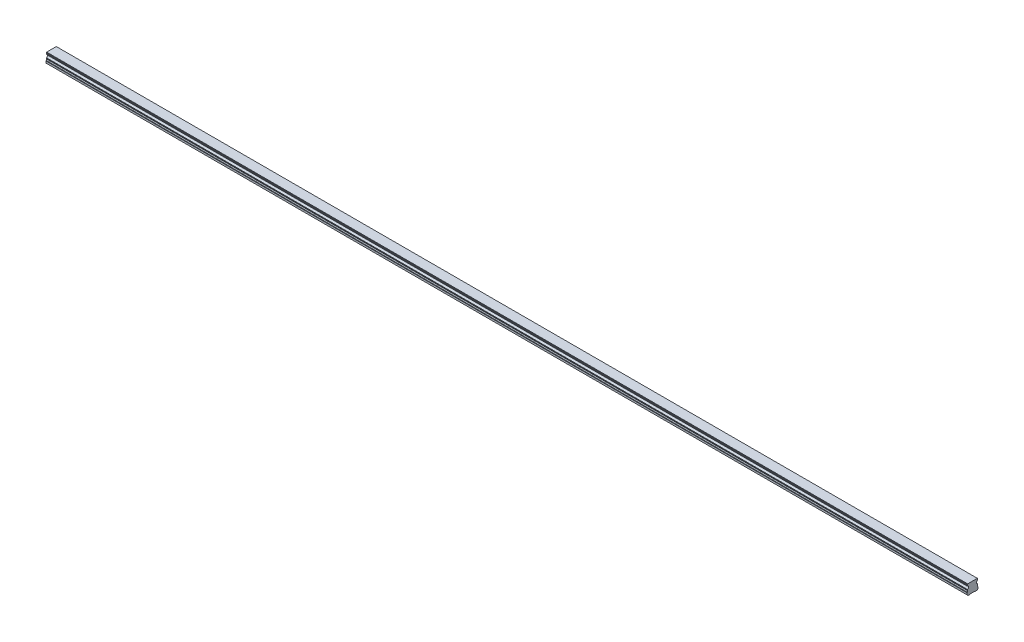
ISO-10303-21;
HEADER;
FILE_DESCRIPTION(('STEP AP214'),'2;1');
FILE_NAME('part.step','',(''),(''),'','','');
FILE_SCHEMA(('AUTOMOTIVE_DESIGN { 1 0 10303 214 1 1 1 1 }'));
ENDSEC;
DATA;
#1=APPLICATION_CONTEXT('core data for automotive mechanical design processes');
#2=APPLICATION_PROTOCOL_DEFINITION('international standard','automotive_design',2000,#1);
#3=PRODUCT_CONTEXT('',#1,'mechanical');
#4=PRODUCT('Part','Part','',(#3));
#5=PRODUCT_RELATED_PRODUCT_CATEGORY('part','',(#4));
#6=PRODUCT_DEFINITION_FORMATION('','',#4);
#7=PRODUCT_DEFINITION_CONTEXT('part definition',#1,'design');
#8=PRODUCT_DEFINITION('design','',#6,#7);
#9=PRODUCT_DEFINITION_SHAPE('','',#8);
#10=(LENGTH_UNIT() NAMED_UNIT(*) SI_UNIT(.MILLI.,.METRE.));
#11=(NAMED_UNIT(*) PLANE_ANGLE_UNIT() SI_UNIT($,.RADIAN.));
#12=(NAMED_UNIT(*) SI_UNIT($,.STERADIAN.) SOLID_ANGLE_UNIT());
#13=UNCERTAINTY_MEASURE_WITH_UNIT(LENGTH_MEASURE(1.E-05),#10,'distance_accuracy_value','');
#14=(GEOMETRIC_REPRESENTATION_CONTEXT(3) GLOBAL_UNCERTAINTY_ASSIGNED_CONTEXT((#13)) GLOBAL_UNIT_ASSIGNED_CONTEXT((#10,
#11,#12)) REPRESENTATION_CONTEXT('',''));
#15=CARTESIAN_POINT('',(0.,0.,0.));
#16=DIRECTION('',(0.,0.,1.));
#17=DIRECTION('',(1.,0.,0.));
#18=AXIS2_PLACEMENT_3D('',#15,#16,#17);
#19=CARTESIAN_POINT('',(1230.,0.399999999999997,0.));
#20=DIRECTION('',(0.,-1.,0.));
#21=DIRECTION('',(0.,0.,-1.));
#22=AXIS2_PLACEMENT_3D('',#19,#20,#21);
#23=CONICAL_SURFACE('',#22,2.90000000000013,0.785398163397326);
#24=CARTESIAN_POINT('',(1230.,0.80000000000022,0.));
#25=DIRECTION('',(0.,1.,0.));
#26=DIRECTION('',(0.,0.,1.));
#27=AXIS2_PLACEMENT_3D('',#24,#25,#26);
#28=CIRCLE('',#27,2.5);
#29=CARTESIAN_POINT('',(1230.,0.800000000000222,2.5));
#30=VERTEX_POINT('',#29);
#31=EDGE_CURVE('E11',#30,#30,#28,.F.);
#32=ORIENTED_EDGE('',*,*,#31,.F.);
#33=EDGE_LOOP('',(#32));
#34=FACE_BOUND('',#33,.T.);
#35=CARTESIAN_POINT('',(1230.,0.399999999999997,0.));
#36=DIRECTION('',(0.,1.,0.));
#37=DIRECTION('',(0.,0.,1.));
#38=AXIS2_PLACEMENT_3D('',#35,#36,#37);
#39=CIRCLE('',#38,2.90000000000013);
#40=CARTESIAN_POINT('',(1230.,0.399999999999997,2.90000000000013));
#41=VERTEX_POINT('',#40);
#42=EDGE_CURVE('E649',#41,#41,#39,.T.);
#43=ORIENTED_EDGE('',*,*,#42,.F.);
#44=EDGE_LOOP('',(#43));
#45=FACE_BOUND('',#44,.T.);
#46=ADVANCED_FACE('F39',(#34,#45),#23,.F.);
#47=CARTESIAN_POINT('',(1230.,7.,0.));
#48=DIRECTION('',(0.,-1.,0.));
#49=DIRECTION('',(0.,0.,-1.));
#50=AXIS2_PLACEMENT_3D('',#47,#48,#49);
#51=CYLINDRICAL_SURFACE('',#50,2.5);
#52=ORIENTED_EDGE('',*,*,#31,.T.);
#53=EDGE_LOOP('',(#52));
#54=FACE_BOUND('',#53,.T.);
#55=CARTESIAN_POINT('',(1230.,7.,0.));
#56=DIRECTION('',(0.,-1.,0.));
#57=DIRECTION('',(0.,0.,-1.));
#58=AXIS2_PLACEMENT_3D('',#55,#56,#57);
#59=CIRCLE('',#58,2.5);
#60=CARTESIAN_POINT('',(1230.,7.,-2.50000000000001));
#61=VERTEX_POINT('',#60);
#62=EDGE_CURVE('E49',#61,#61,#59,.T.);
#63=ORIENTED_EDGE('',*,*,#62,.F.);
#64=EDGE_LOOP('',(#63));
#65=FACE_BOUND('',#64,.T.);
#66=ADVANCED_FACE('F903',(#54,#65),#51,.F.);
#67=CARTESIAN_POINT('',(1230.,7.,0.));
#68=DIRECTION('',(0.,-1.,0.));
#69=DIRECTION('',(0.,0.,-1.));
#70=AXIS2_PLACEMENT_3D('',#67,#68,#69);
#71=PLANE('',#70);
#72=CARTESIAN_POINT('',(1230.,7.,0.));
#73=DIRECTION('',(0.,-1.,0.));
#74=DIRECTION('',(0.,0.,-1.));
#75=AXIS2_PLACEMENT_3D('',#72,#73,#74);
#76=CIRCLE('',#75,2.1);
#77=CARTESIAN_POINT('',(1230.,7.,-2.1));
#78=VERTEX_POINT('',#77);
#79=EDGE_CURVE('E42',#78,#78,#76,.T.);
#80=ORIENTED_EDGE('',*,*,#79,.F.);
#81=EDGE_LOOP('',(#80));
#82=FACE_BOUND('',#81,.T.);
#83=ORIENTED_EDGE('',*,*,#62,.T.);
#84=EDGE_LOOP('',(#83));
#85=FACE_BOUND('',#84,.T.);
#86=ADVANCED_FACE('F908',(#82,#85),#71,.T.);
#87=CARTESIAN_POINT('',(1170.,0.399999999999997,0.));
#88=DIRECTION('',(0.,-1.,0.));
#89=DIRECTION('',(0.,0.,-1.));
#90=AXIS2_PLACEMENT_3D('',#87,#88,#89);
#91=CONICAL_SURFACE('',#90,2.90000000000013,0.785398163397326);
#92=CARTESIAN_POINT('',(1170.,0.80000000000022,0.));
#93=DIRECTION('',(0.,1.,0.));
#94=DIRECTION('',(0.,0.,1.));
#95=AXIS2_PLACEMENT_3D('',#92,#93,#94);
#96=CIRCLE('',#95,2.5);
#97=CARTESIAN_POINT('',(1170.,0.800000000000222,2.5));
#98=VERTEX_POINT('',#97);
#99=EDGE_CURVE('E645',#98,#98,#96,.F.);
#100=ORIENTED_EDGE('',*,*,#99,.F.);
#101=EDGE_LOOP('',(#100));
#102=FACE_BOUND('',#101,.T.);
#103=CARTESIAN_POINT('',(1170.,0.399999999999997,0.));
#104=DIRECTION('',(0.,1.,0.));
#105=DIRECTION('',(0.,0.,1.));
#106=AXIS2_PLACEMENT_3D('',#103,#104,#105);
#107=CIRCLE('',#106,2.90000000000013);
#108=CARTESIAN_POINT('',(1170.,0.399999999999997,2.90000000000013));
#109=VERTEX_POINT('',#108);
#110=EDGE_CURVE('E637',#109,#109,#107,.T.);
#111=ORIENTED_EDGE('',*,*,#110,.F.);
#112=EDGE_LOOP('',(#111));
#113=FACE_BOUND('',#112,.T.);
#114=ADVANCED_FACE('F1199',(#102,#113),#91,.F.);
#115=CARTESIAN_POINT('',(1170.,7.,0.));
#116=DIRECTION('',(0.,-1.,0.));
#117=DIRECTION('',(0.,0.,-1.));
#118=AXIS2_PLACEMENT_3D('',#115,#116,#117);
#119=CYLINDRICAL_SURFACE('',#118,2.5);
#120=ORIENTED_EDGE('',*,*,#99,.T.);
#121=EDGE_LOOP('',(#120));
#122=FACE_BOUND('',#121,.T.);
#123=CARTESIAN_POINT('',(1170.,7.,0.));
#124=DIRECTION('',(0.,-1.,0.));
#125=DIRECTION('',(0.,0.,-1.));
#126=AXIS2_PLACEMENT_3D('',#123,#124,#125);
#127=CIRCLE('',#126,2.5);
#128=CARTESIAN_POINT('',(1170.,7.,-2.50000000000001));
#129=VERTEX_POINT('',#128);
#130=EDGE_CURVE('E641',#129,#129,#127,.T.);
#131=ORIENTED_EDGE('',*,*,#130,.F.);
#132=EDGE_LOOP('',(#131));
#133=FACE_BOUND('',#132,.T.);
#134=ADVANCED_FACE('F1195',(#122,#133),#119,.F.);
#135=CARTESIAN_POINT('',(1170.,7.,0.));
#136=DIRECTION('',(0.,-1.,0.));
#137=DIRECTION('',(0.,0.,-1.));
#138=AXIS2_PLACEMENT_3D('',#135,#136,#137);
#139=PLANE('',#138);
#140=CARTESIAN_POINT('',(1170.,7.,0.));
#141=DIRECTION('',(0.,-1.,0.));
#142=DIRECTION('',(0.,0.,-1.));
#143=AXIS2_PLACEMENT_3D('',#140,#141,#142);
#144=CIRCLE('',#143,2.1);
#145=CARTESIAN_POINT('',(1170.,7.,-2.1));
#146=VERTEX_POINT('',#145);
#147=EDGE_CURVE('E728',#146,#146,#144,.T.);
#148=ORIENTED_EDGE('',*,*,#147,.F.);
#149=EDGE_LOOP('',(#148));
#150=FACE_BOUND('',#149,.T.);
#151=ORIENTED_EDGE('',*,*,#130,.T.);
#152=EDGE_LOOP('',(#151));
#153=FACE_BOUND('',#152,.T.);
#154=ADVANCED_FACE('F1191',(#150,#153),#139,.T.);
#155=CARTESIAN_POINT('',(1110.,0.399999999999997,0.));
#156=DIRECTION('',(0.,-1.,0.));
#157=DIRECTION('',(0.,0.,-1.));
#158=AXIS2_PLACEMENT_3D('',#155,#156,#157);
#159=CONICAL_SURFACE('',#158,2.90000000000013,0.785398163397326);
#160=CARTESIAN_POINT('',(1110.,0.80000000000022,0.));
#161=DIRECTION('',(0.,1.,0.));
#162=DIRECTION('',(0.,0.,1.));
#163=AXIS2_PLACEMENT_3D('',#160,#161,#162);
#164=CIRCLE('',#163,2.5);
#165=CARTESIAN_POINT('',(1110.,0.800000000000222,2.5));
#166=VERTEX_POINT('',#165);
#167=EDGE_CURVE('E633',#166,#166,#164,.F.);
#168=ORIENTED_EDGE('',*,*,#167,.F.);
#169=EDGE_LOOP('',(#168));
#170=FACE_BOUND('',#169,.T.);
#171=CARTESIAN_POINT('',(1110.,0.399999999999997,0.));
#172=DIRECTION('',(0.,1.,0.));
#173=DIRECTION('',(0.,0.,1.));
#174=AXIS2_PLACEMENT_3D('',#171,#172,#173);
#175=CIRCLE('',#174,2.90000000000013);
#176=CARTESIAN_POINT('',(1110.,0.399999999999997,2.90000000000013));
#177=VERTEX_POINT('',#176);
#178=EDGE_CURVE('E625',#177,#177,#175,.T.);
#179=ORIENTED_EDGE('',*,*,#178,.F.);
#180=EDGE_LOOP('',(#179));
#181=FACE_BOUND('',#180,.T.);
#182=ADVANCED_FACE('F1187',(#170,#181),#159,.F.);
#183=CARTESIAN_POINT('',(1110.,7.,0.));
#184=DIRECTION('',(0.,-1.,0.));
#185=DIRECTION('',(0.,0.,-1.));
#186=AXIS2_PLACEMENT_3D('',#183,#184,#185);
#187=CYLINDRICAL_SURFACE('',#186,2.5);
#188=ORIENTED_EDGE('',*,*,#167,.T.);
#189=EDGE_LOOP('',(#188));
#190=FACE_BOUND('',#189,.T.);
#191=CARTESIAN_POINT('',(1110.,7.,0.));
#192=DIRECTION('',(0.,-1.,0.));
#193=DIRECTION('',(0.,0.,-1.));
#194=AXIS2_PLACEMENT_3D('',#191,#192,#193);
#195=CIRCLE('',#194,2.5);
#196=CARTESIAN_POINT('',(1110.,7.,-2.50000000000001));
#197=VERTEX_POINT('',#196);
#198=EDGE_CURVE('E629',#197,#197,#195,.T.);
#199=ORIENTED_EDGE('',*,*,#198,.F.);
#200=EDGE_LOOP('',(#199));
#201=FACE_BOUND('',#200,.T.);
#202=ADVANCED_FACE('F1183',(#190,#201),#187,.F.);
#203=CARTESIAN_POINT('',(1110.,7.,0.));
#204=DIRECTION('',(0.,-1.,0.));
#205=DIRECTION('',(0.,0.,-1.));
#206=AXIS2_PLACEMENT_3D('',#203,#204,#205);
#207=PLANE('',#206);
#208=CARTESIAN_POINT('',(1110.,7.,0.));
#209=DIRECTION('',(0.,-1.,0.));
#210=DIRECTION('',(0.,0.,-1.));
#211=AXIS2_PLACEMENT_3D('',#208,#209,#210);
#212=CIRCLE('',#211,2.1);
#213=CARTESIAN_POINT('',(1110.,7.,-2.1));
#214=VERTEX_POINT('',#213);
#215=EDGE_CURVE('E725',#214,#214,#212,.T.);
#216=ORIENTED_EDGE('',*,*,#215,.F.);
#217=EDGE_LOOP('',(#216));
#218=FACE_BOUND('',#217,.T.);
#219=ORIENTED_EDGE('',*,*,#198,.T.);
#220=EDGE_LOOP('',(#219));
#221=FACE_BOUND('',#220,.T.);
#222=ADVANCED_FACE('F1179',(#218,#221),#207,.T.);
#223=CARTESIAN_POINT('',(1050.,0.399999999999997,0.));
#224=DIRECTION('',(0.,-1.,0.));
#225=DIRECTION('',(0.,0.,-1.));
#226=AXIS2_PLACEMENT_3D('',#223,#224,#225);
#227=CONICAL_SURFACE('',#226,2.90000000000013,0.785398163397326);
#228=CARTESIAN_POINT('',(1050.,0.80000000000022,0.));
#229=DIRECTION('',(0.,1.,0.));
#230=DIRECTION('',(0.,0.,1.));
#231=AXIS2_PLACEMENT_3D('',#228,#229,#230);
#232=CIRCLE('',#231,2.5);
#233=CARTESIAN_POINT('',(1050.,0.800000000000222,2.5));
#234=VERTEX_POINT('',#233);
#235=EDGE_CURVE('E621',#234,#234,#232,.F.);
#236=ORIENTED_EDGE('',*,*,#235,.F.);
#237=EDGE_LOOP('',(#236));
#238=FACE_BOUND('',#237,.T.);
#239=CARTESIAN_POINT('',(1050.,0.399999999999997,0.));
#240=DIRECTION('',(0.,1.,0.));
#241=DIRECTION('',(0.,0.,1.));
#242=AXIS2_PLACEMENT_3D('',#239,#240,#241);
#243=CIRCLE('',#242,2.90000000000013);
#244=CARTESIAN_POINT('',(1050.,0.399999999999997,2.90000000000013));
#245=VERTEX_POINT('',#244);
#246=EDGE_CURVE('E613',#245,#245,#243,.T.);
#247=ORIENTED_EDGE('',*,*,#246,.F.);
#248=EDGE_LOOP('',(#247));
#249=FACE_BOUND('',#248,.T.);
#250=ADVANCED_FACE('F1175',(#238,#249),#227,.F.);
#251=CARTESIAN_POINT('',(1050.,7.,0.));
#252=DIRECTION('',(0.,-1.,0.));
#253=DIRECTION('',(0.,0.,-1.));
#254=AXIS2_PLACEMENT_3D('',#251,#252,#253);
#255=CYLINDRICAL_SURFACE('',#254,2.5);
#256=ORIENTED_EDGE('',*,*,#235,.T.);
#257=EDGE_LOOP('',(#256));
#258=FACE_BOUND('',#257,.T.);
#259=CARTESIAN_POINT('',(1050.,7.,0.));
#260=DIRECTION('',(0.,-1.,0.));
#261=DIRECTION('',(0.,0.,-1.));
#262=AXIS2_PLACEMENT_3D('',#259,#260,#261);
#263=CIRCLE('',#262,2.5);
#264=CARTESIAN_POINT('',(1050.,7.,-2.50000000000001));
#265=VERTEX_POINT('',#264);
#266=EDGE_CURVE('E617',#265,#265,#263,.T.);
#267=ORIENTED_EDGE('',*,*,#266,.F.);
#268=EDGE_LOOP('',(#267));
#269=FACE_BOUND('',#268,.T.);
#270=ADVANCED_FACE('F1171',(#258,#269),#255,.F.);
#271=CARTESIAN_POINT('',(1050.,7.,0.));
#272=DIRECTION('',(0.,-1.,0.));
#273=DIRECTION('',(0.,0.,-1.));
#274=AXIS2_PLACEMENT_3D('',#271,#272,#273);
#275=PLANE('',#274);
#276=CARTESIAN_POINT('',(1050.,7.,0.));
#277=DIRECTION('',(0.,-1.,0.));
#278=DIRECTION('',(0.,0.,-1.));
#279=AXIS2_PLACEMENT_3D('',#276,#277,#278);
#280=CIRCLE('',#279,2.1);
#281=CARTESIAN_POINT('',(1050.,7.,-2.1));
#282=VERTEX_POINT('',#281);
#283=EDGE_CURVE('E721',#282,#282,#280,.T.);
#284=ORIENTED_EDGE('',*,*,#283,.F.);
#285=EDGE_LOOP('',(#284));
#286=FACE_BOUND('',#285,.T.);
#287=ORIENTED_EDGE('',*,*,#266,.T.);
#288=EDGE_LOOP('',(#287));
#289=FACE_BOUND('',#288,.T.);
#290=ADVANCED_FACE('F1167',(#286,#289),#275,.T.);
#291=CARTESIAN_POINT('',(990.,0.399999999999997,0.));
#292=DIRECTION('',(0.,-1.,0.));
#293=DIRECTION('',(0.,0.,-1.));
#294=AXIS2_PLACEMENT_3D('',#291,#292,#293);
#295=CONICAL_SURFACE('',#294,2.90000000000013,0.785398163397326);
#296=CARTESIAN_POINT('',(990.,0.80000000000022,0.));
#297=DIRECTION('',(0.,1.,0.));
#298=DIRECTION('',(0.,0.,1.));
#299=AXIS2_PLACEMENT_3D('',#296,#297,#298);
#300=CIRCLE('',#299,2.5);
#301=CARTESIAN_POINT('',(990.,0.800000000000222,2.5));
#302=VERTEX_POINT('',#301);
#303=EDGE_CURVE('E609',#302,#302,#300,.F.);
#304=ORIENTED_EDGE('',*,*,#303,.F.);
#305=EDGE_LOOP('',(#304));
#306=FACE_BOUND('',#305,.T.);
#307=CARTESIAN_POINT('',(990.,0.399999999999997,0.));
#308=DIRECTION('',(0.,1.,0.));
#309=DIRECTION('',(0.,0.,1.));
#310=AXIS2_PLACEMENT_3D('',#307,#308,#309);
#311=CIRCLE('',#310,2.90000000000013);
#312=CARTESIAN_POINT('',(990.,0.399999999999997,2.90000000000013));
#313=VERTEX_POINT('',#312);
#314=EDGE_CURVE('E601',#313,#313,#311,.T.);
#315=ORIENTED_EDGE('',*,*,#314,.F.);
#316=EDGE_LOOP('',(#315));
#317=FACE_BOUND('',#316,.T.);
#318=ADVANCED_FACE('F1163',(#306,#317),#295,.F.);
#319=CARTESIAN_POINT('',(990.,7.,0.));
#320=DIRECTION('',(0.,-1.,0.));
#321=DIRECTION('',(0.,0.,-1.));
#322=AXIS2_PLACEMENT_3D('',#319,#320,#321);
#323=CYLINDRICAL_SURFACE('',#322,2.5);
#324=ORIENTED_EDGE('',*,*,#303,.T.);
#325=EDGE_LOOP('',(#324));
#326=FACE_BOUND('',#325,.T.);
#327=CARTESIAN_POINT('',(990.,7.,0.));
#328=DIRECTION('',(0.,-1.,0.));
#329=DIRECTION('',(0.,0.,-1.));
#330=AXIS2_PLACEMENT_3D('',#327,#328,#329);
#331=CIRCLE('',#330,2.5);
#332=CARTESIAN_POINT('',(990.,7.,-2.50000000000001));
#333=VERTEX_POINT('',#332);
#334=EDGE_CURVE('E605',#333,#333,#331,.T.);
#335=ORIENTED_EDGE('',*,*,#334,.F.);
#336=EDGE_LOOP('',(#335));
#337=FACE_BOUND('',#336,.T.);
#338=ADVANCED_FACE('F1159',(#326,#337),#323,.F.);
#339=CARTESIAN_POINT('',(990.,7.,0.));
#340=DIRECTION('',(0.,-1.,0.));
#341=DIRECTION('',(0.,0.,-1.));
#342=AXIS2_PLACEMENT_3D('',#339,#340,#341);
#343=PLANE('',#342);
#344=CARTESIAN_POINT('',(990.,7.,0.));
#345=DIRECTION('',(0.,-1.,0.));
#346=DIRECTION('',(0.,0.,-1.));
#347=AXIS2_PLACEMENT_3D('',#344,#345,#346);
#348=CIRCLE('',#347,2.1);
#349=CARTESIAN_POINT('',(990.,7.,-2.1));
#350=VERTEX_POINT('',#349);
#351=EDGE_CURVE('E717',#350,#350,#348,.T.);
#352=ORIENTED_EDGE('',*,*,#351,.F.);
#353=EDGE_LOOP('',(#352));
#354=FACE_BOUND('',#353,.T.);
#355=ORIENTED_EDGE('',*,*,#334,.T.);
#356=EDGE_LOOP('',(#355));
#357=FACE_BOUND('',#356,.T.);
#358=ADVANCED_FACE('F1155',(#354,#357),#343,.T.);
#359=CARTESIAN_POINT('',(930.,0.399999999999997,0.));
#360=DIRECTION('',(0.,-1.,0.));
#361=DIRECTION('',(0.,0.,-1.));
#362=AXIS2_PLACEMENT_3D('',#359,#360,#361);
#363=CONICAL_SURFACE('',#362,2.90000000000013,0.785398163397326);
#364=CARTESIAN_POINT('',(930.,0.80000000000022,0.));
#365=DIRECTION('',(0.,1.,0.));
#366=DIRECTION('',(0.,0.,1.));
#367=AXIS2_PLACEMENT_3D('',#364,#365,#366);
#368=CIRCLE('',#367,2.5);
#369=CARTESIAN_POINT('',(930.,0.800000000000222,2.5));
#370=VERTEX_POINT('',#369);
#371=EDGE_CURVE('E597',#370,#370,#368,.F.);
#372=ORIENTED_EDGE('',*,*,#371,.F.);
#373=EDGE_LOOP('',(#372));
#374=FACE_BOUND('',#373,.T.);
#375=CARTESIAN_POINT('',(930.,0.399999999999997,0.));
#376=DIRECTION('',(0.,1.,0.));
#377=DIRECTION('',(0.,0.,1.));
#378=AXIS2_PLACEMENT_3D('',#375,#376,#377);
#379=CIRCLE('',#378,2.90000000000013);
#380=CARTESIAN_POINT('',(930.,0.399999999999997,2.90000000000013));
#381=VERTEX_POINT('',#380);
#382=EDGE_CURVE('E589',#381,#381,#379,.T.);
#383=ORIENTED_EDGE('',*,*,#382,.F.);
#384=EDGE_LOOP('',(#383));
#385=FACE_BOUND('',#384,.T.);
#386=ADVANCED_FACE('F1151',(#374,#385),#363,.F.);
#387=CARTESIAN_POINT('',(930.,7.,0.));
#388=DIRECTION('',(0.,-1.,0.));
#389=DIRECTION('',(0.,0.,-1.));
#390=AXIS2_PLACEMENT_3D('',#387,#388,#389);
#391=CYLINDRICAL_SURFACE('',#390,2.5);
#392=ORIENTED_EDGE('',*,*,#371,.T.);
#393=EDGE_LOOP('',(#392));
#394=FACE_BOUND('',#393,.T.);
#395=CARTESIAN_POINT('',(930.,7.,0.));
#396=DIRECTION('',(0.,-1.,0.));
#397=DIRECTION('',(0.,0.,-1.));
#398=AXIS2_PLACEMENT_3D('',#395,#396,#397);
#399=CIRCLE('',#398,2.5);
#400=CARTESIAN_POINT('',(930.,7.,-2.50000000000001));
#401=VERTEX_POINT('',#400);
#402=EDGE_CURVE('E593',#401,#401,#399,.T.);
#403=ORIENTED_EDGE('',*,*,#402,.F.);
#404=EDGE_LOOP('',(#403));
#405=FACE_BOUND('',#404,.T.);
#406=ADVANCED_FACE('F1147',(#394,#405),#391,.F.);
#407=CARTESIAN_POINT('',(930.,7.,0.));
#408=DIRECTION('',(0.,-1.,0.));
#409=DIRECTION('',(0.,0.,-1.));
#410=AXIS2_PLACEMENT_3D('',#407,#408,#409);
#411=PLANE('',#410);
#412=CARTESIAN_POINT('',(930.,7.,0.));
#413=DIRECTION('',(0.,-1.,0.));
#414=DIRECTION('',(0.,0.,-1.));
#415=AXIS2_PLACEMENT_3D('',#412,#413,#414);
#416=CIRCLE('',#415,2.1);
#417=CARTESIAN_POINT('',(930.,7.,-2.1));
#418=VERTEX_POINT('',#417);
#419=EDGE_CURVE('E713',#418,#418,#416,.T.);
#420=ORIENTED_EDGE('',*,*,#419,.F.);
#421=EDGE_LOOP('',(#420));
#422=FACE_BOUND('',#421,.T.);
#423=ORIENTED_EDGE('',*,*,#402,.T.);
#424=EDGE_LOOP('',(#423));
#425=FACE_BOUND('',#424,.T.);
#426=ADVANCED_FACE('F1143',(#422,#425),#411,.T.);
#427=CARTESIAN_POINT('',(870.,0.399999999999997,0.));
#428=DIRECTION('',(0.,-1.,0.));
#429=DIRECTION('',(0.,0.,-1.));
#430=AXIS2_PLACEMENT_3D('',#427,#428,#429);
#431=CONICAL_SURFACE('',#430,2.90000000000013,0.785398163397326);
#432=CARTESIAN_POINT('',(870.,0.80000000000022,0.));
#433=DIRECTION('',(0.,1.,0.));
#434=DIRECTION('',(0.,0.,1.));
#435=AXIS2_PLACEMENT_3D('',#432,#433,#434);
#436=CIRCLE('',#435,2.5);
#437=CARTESIAN_POINT('',(870.,0.800000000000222,2.5));
#438=VERTEX_POINT('',#437);
#439=EDGE_CURVE('E585',#438,#438,#436,.F.);
#440=ORIENTED_EDGE('',*,*,#439,.F.);
#441=EDGE_LOOP('',(#440));
#442=FACE_BOUND('',#441,.T.);
#443=CARTESIAN_POINT('',(870.,0.399999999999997,0.));
#444=DIRECTION('',(0.,1.,0.));
#445=DIRECTION('',(0.,0.,1.));
#446=AXIS2_PLACEMENT_3D('',#443,#444,#445);
#447=CIRCLE('',#446,2.90000000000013);
#448=CARTESIAN_POINT('',(870.,0.399999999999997,2.90000000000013));
#449=VERTEX_POINT('',#448);
#450=EDGE_CURVE('E577',#449,#449,#447,.T.);
#451=ORIENTED_EDGE('',*,*,#450,.F.);
#452=EDGE_LOOP('',(#451));
#453=FACE_BOUND('',#452,.T.);
#454=ADVANCED_FACE('F1139',(#442,#453),#431,.F.);
#455=CARTESIAN_POINT('',(870.,7.,0.));
#456=DIRECTION('',(0.,-1.,0.));
#457=DIRECTION('',(0.,0.,-1.));
#458=AXIS2_PLACEMENT_3D('',#455,#456,#457);
#459=CYLINDRICAL_SURFACE('',#458,2.5);
#460=ORIENTED_EDGE('',*,*,#439,.T.);
#461=EDGE_LOOP('',(#460));
#462=FACE_BOUND('',#461,.T.);
#463=CARTESIAN_POINT('',(870.,7.,0.));
#464=DIRECTION('',(0.,-1.,0.));
#465=DIRECTION('',(0.,0.,-1.));
#466=AXIS2_PLACEMENT_3D('',#463,#464,#465);
#467=CIRCLE('',#466,2.5);
#468=CARTESIAN_POINT('',(870.,7.,-2.50000000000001));
#469=VERTEX_POINT('',#468);
#470=EDGE_CURVE('E581',#469,#469,#467,.T.);
#471=ORIENTED_EDGE('',*,*,#470,.F.);
#472=EDGE_LOOP('',(#471));
#473=FACE_BOUND('',#472,.T.);
#474=ADVANCED_FACE('F1135',(#462,#473),#459,.F.);
#475=CARTESIAN_POINT('',(870.,7.,0.));
#476=DIRECTION('',(0.,-1.,0.));
#477=DIRECTION('',(0.,0.,-1.));
#478=AXIS2_PLACEMENT_3D('',#475,#476,#477);
#479=PLANE('',#478);
#480=CARTESIAN_POINT('',(870.,7.,0.));
#481=DIRECTION('',(0.,-1.,0.));
#482=DIRECTION('',(0.,0.,-1.));
#483=AXIS2_PLACEMENT_3D('',#480,#481,#482);
#484=CIRCLE('',#483,2.1);
#485=CARTESIAN_POINT('',(870.,7.,-2.1));
#486=VERTEX_POINT('',#485);
#487=EDGE_CURVE('E709',#486,#486,#484,.T.);
#488=ORIENTED_EDGE('',*,*,#487,.F.);
#489=EDGE_LOOP('',(#488));
#490=FACE_BOUND('',#489,.T.);
#491=ORIENTED_EDGE('',*,*,#470,.T.);
#492=EDGE_LOOP('',(#491));
#493=FACE_BOUND('',#492,.T.);
#494=ADVANCED_FACE('F1131',(#490,#493),#479,.T.);
#495=CARTESIAN_POINT('',(810.,0.399999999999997,0.));
#496=DIRECTION('',(0.,-1.,0.));
#497=DIRECTION('',(0.,0.,-1.));
#498=AXIS2_PLACEMENT_3D('',#495,#496,#497);
#499=CONICAL_SURFACE('',#498,2.90000000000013,0.785398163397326);
#500=CARTESIAN_POINT('',(810.,0.80000000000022,0.));
#501=DIRECTION('',(0.,1.,0.));
#502=DIRECTION('',(0.,0.,1.));
#503=AXIS2_PLACEMENT_3D('',#500,#501,#502);
#504=CIRCLE('',#503,2.5);
#505=CARTESIAN_POINT('',(810.,0.800000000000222,2.5));
#506=VERTEX_POINT('',#505);
#507=EDGE_CURVE('E573',#506,#506,#504,.F.);
#508=ORIENTED_EDGE('',*,*,#507,.F.);
#509=EDGE_LOOP('',(#508));
#510=FACE_BOUND('',#509,.T.);
#511=CARTESIAN_POINT('',(810.,0.399999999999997,0.));
#512=DIRECTION('',(0.,1.,0.));
#513=DIRECTION('',(0.,0.,1.));
#514=AXIS2_PLACEMENT_3D('',#511,#512,#513);
#515=CIRCLE('',#514,2.90000000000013);
#516=CARTESIAN_POINT('',(810.,0.399999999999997,2.90000000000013));
#517=VERTEX_POINT('',#516);
#518=EDGE_CURVE('E565',#517,#517,#515,.T.);
#519=ORIENTED_EDGE('',*,*,#518,.F.);
#520=EDGE_LOOP('',(#519));
#521=FACE_BOUND('',#520,.T.);
#522=ADVANCED_FACE('F1127',(#510,#521),#499,.F.);
#523=CARTESIAN_POINT('',(810.,7.,0.));
#524=DIRECTION('',(0.,-1.,0.));
#525=DIRECTION('',(0.,0.,-1.));
#526=AXIS2_PLACEMENT_3D('',#523,#524,#525);
#527=CYLINDRICAL_SURFACE('',#526,2.5);
#528=ORIENTED_EDGE('',*,*,#507,.T.);
#529=EDGE_LOOP('',(#528));
#530=FACE_BOUND('',#529,.T.);
#531=CARTESIAN_POINT('',(810.,7.,0.));
#532=DIRECTION('',(0.,-1.,0.));
#533=DIRECTION('',(0.,0.,-1.));
#534=AXIS2_PLACEMENT_3D('',#531,#532,#533);
#535=CIRCLE('',#534,2.5);
#536=CARTESIAN_POINT('',(810.,7.,-2.50000000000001));
#537=VERTEX_POINT('',#536);
#538=EDGE_CURVE('E569',#537,#537,#535,.T.);
#539=ORIENTED_EDGE('',*,*,#538,.F.);
#540=EDGE_LOOP('',(#539));
#541=FACE_BOUND('',#540,.T.);
#542=ADVANCED_FACE('F1123',(#530,#541),#527,.F.);
#543=CARTESIAN_POINT('',(810.,7.,0.));
#544=DIRECTION('',(0.,-1.,0.));
#545=DIRECTION('',(0.,0.,-1.));
#546=AXIS2_PLACEMENT_3D('',#543,#544,#545);
#547=PLANE('',#546);
#548=CARTESIAN_POINT('',(810.,7.,0.));
#549=DIRECTION('',(0.,-1.,0.));
#550=DIRECTION('',(0.,0.,-1.));
#551=AXIS2_PLACEMENT_3D('',#548,#549,#550);
#552=CIRCLE('',#551,2.1);
#553=CARTESIAN_POINT('',(810.,7.,-2.1));
#554=VERTEX_POINT('',#553);
#555=EDGE_CURVE('E705',#554,#554,#552,.T.);
#556=ORIENTED_EDGE('',*,*,#555,.F.);
#557=EDGE_LOOP('',(#556));
#558=FACE_BOUND('',#557,.T.);
#559=ORIENTED_EDGE('',*,*,#538,.T.);
#560=EDGE_LOOP('',(#559));
#561=FACE_BOUND('',#560,.T.);
#562=ADVANCED_FACE('F1119',(#558,#561),#547,.T.);
#563=CARTESIAN_POINT('',(750.,0.399999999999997,0.));
#564=DIRECTION('',(0.,-1.,0.));
#565=DIRECTION('',(0.,0.,-1.));
#566=AXIS2_PLACEMENT_3D('',#563,#564,#565);
#567=CONICAL_SURFACE('',#566,2.90000000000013,0.785398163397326);
#568=CARTESIAN_POINT('',(750.,0.80000000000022,0.));
#569=DIRECTION('',(0.,1.,0.));
#570=DIRECTION('',(0.,0.,1.));
#571=AXIS2_PLACEMENT_3D('',#568,#569,#570);
#572=CIRCLE('',#571,2.5);
#573=CARTESIAN_POINT('',(750.,0.800000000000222,2.5));
#574=VERTEX_POINT('',#573);
#575=EDGE_CURVE('E561',#574,#574,#572,.F.);
#576=ORIENTED_EDGE('',*,*,#575,.F.);
#577=EDGE_LOOP('',(#576));
#578=FACE_BOUND('',#577,.T.);
#579=CARTESIAN_POINT('',(750.,0.399999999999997,0.));
#580=DIRECTION('',(0.,1.,0.));
#581=DIRECTION('',(0.,0.,1.));
#582=AXIS2_PLACEMENT_3D('',#579,#580,#581);
#583=CIRCLE('',#582,2.90000000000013);
#584=CARTESIAN_POINT('',(750.,0.399999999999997,2.90000000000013));
#585=VERTEX_POINT('',#584);
#586=EDGE_CURVE('E553',#585,#585,#583,.T.);
#587=ORIENTED_EDGE('',*,*,#586,.F.);
#588=EDGE_LOOP('',(#587));
#589=FACE_BOUND('',#588,.T.);
#590=ADVANCED_FACE('F1115',(#578,#589),#567,.F.);
#591=CARTESIAN_POINT('',(750.,7.,0.));
#592=DIRECTION('',(0.,-1.,0.));
#593=DIRECTION('',(0.,0.,-1.));
#594=AXIS2_PLACEMENT_3D('',#591,#592,#593);
#595=CYLINDRICAL_SURFACE('',#594,2.5);
#596=ORIENTED_EDGE('',*,*,#575,.T.);
#597=EDGE_LOOP('',(#596));
#598=FACE_BOUND('',#597,.T.);
#599=CARTESIAN_POINT('',(750.,7.,0.));
#600=DIRECTION('',(0.,-1.,0.));
#601=DIRECTION('',(0.,0.,-1.));
#602=AXIS2_PLACEMENT_3D('',#599,#600,#601);
#603=CIRCLE('',#602,2.5);
#604=CARTESIAN_POINT('',(750.,7.,-2.50000000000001));
#605=VERTEX_POINT('',#604);
#606=EDGE_CURVE('E557',#605,#605,#603,.T.);
#607=ORIENTED_EDGE('',*,*,#606,.F.);
#608=EDGE_LOOP('',(#607));
#609=FACE_BOUND('',#608,.T.);
#610=ADVANCED_FACE('F1111',(#598,#609),#595,.F.);
#611=CARTESIAN_POINT('',(750.,7.,0.));
#612=DIRECTION('',(0.,-1.,0.));
#613=DIRECTION('',(0.,0.,-1.));
#614=AXIS2_PLACEMENT_3D('',#611,#612,#613);
#615=PLANE('',#614);
#616=CARTESIAN_POINT('',(750.,7.,0.));
#617=DIRECTION('',(0.,-1.,0.));
#618=DIRECTION('',(0.,0.,-1.));
#619=AXIS2_PLACEMENT_3D('',#616,#617,#618);
#620=CIRCLE('',#619,2.1);
#621=CARTESIAN_POINT('',(750.,7.,-2.1));
#622=VERTEX_POINT('',#621);
#623=EDGE_CURVE('E701',#622,#622,#620,.T.);
#624=ORIENTED_EDGE('',*,*,#623,.F.);
#625=EDGE_LOOP('',(#624));
#626=FACE_BOUND('',#625,.T.);
#627=ORIENTED_EDGE('',*,*,#606,.T.);
#628=EDGE_LOOP('',(#627));
#629=FACE_BOUND('',#628,.T.);
#630=ADVANCED_FACE('F1107',(#626,#629),#615,.T.);
#631=CARTESIAN_POINT('',(690.,0.399999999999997,0.));
#632=DIRECTION('',(0.,-1.,0.));
#633=DIRECTION('',(0.,0.,-1.));
#634=AXIS2_PLACEMENT_3D('',#631,#632,#633);
#635=CONICAL_SURFACE('',#634,2.90000000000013,0.785398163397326);
#636=CARTESIAN_POINT('',(690.,0.80000000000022,0.));
#637=DIRECTION('',(0.,1.,0.));
#638=DIRECTION('',(0.,0.,1.));
#639=AXIS2_PLACEMENT_3D('',#636,#637,#638);
#640=CIRCLE('',#639,2.5);
#641=CARTESIAN_POINT('',(690.,0.800000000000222,2.5));
#642=VERTEX_POINT('',#641);
#643=EDGE_CURVE('E549',#642,#642,#640,.F.);
#644=ORIENTED_EDGE('',*,*,#643,.F.);
#645=EDGE_LOOP('',(#644));
#646=FACE_BOUND('',#645,.T.);
#647=CARTESIAN_POINT('',(690.,0.399999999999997,0.));
#648=DIRECTION('',(0.,1.,0.));
#649=DIRECTION('',(0.,0.,1.));
#650=AXIS2_PLACEMENT_3D('',#647,#648,#649);
#651=CIRCLE('',#650,2.90000000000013);
#652=CARTESIAN_POINT('',(690.,0.399999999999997,2.90000000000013));
#653=VERTEX_POINT('',#652);
#654=EDGE_CURVE('E541',#653,#653,#651,.T.);
#655=ORIENTED_EDGE('',*,*,#654,.F.);
#656=EDGE_LOOP('',(#655));
#657=FACE_BOUND('',#656,.T.);
#658=ADVANCED_FACE('F1103',(#646,#657),#635,.F.);
#659=CARTESIAN_POINT('',(690.,7.,0.));
#660=DIRECTION('',(0.,-1.,0.));
#661=DIRECTION('',(0.,0.,-1.));
#662=AXIS2_PLACEMENT_3D('',#659,#660,#661);
#663=CYLINDRICAL_SURFACE('',#662,2.5);
#664=ORIENTED_EDGE('',*,*,#643,.T.);
#665=EDGE_LOOP('',(#664));
#666=FACE_BOUND('',#665,.T.);
#667=CARTESIAN_POINT('',(690.,7.,0.));
#668=DIRECTION('',(0.,-1.,0.));
#669=DIRECTION('',(0.,0.,-1.));
#670=AXIS2_PLACEMENT_3D('',#667,#668,#669);
#671=CIRCLE('',#670,2.5);
#672=CARTESIAN_POINT('',(690.,7.,-2.50000000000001));
#673=VERTEX_POINT('',#672);
#674=EDGE_CURVE('E545',#673,#673,#671,.T.);
#675=ORIENTED_EDGE('',*,*,#674,.F.);
#676=EDGE_LOOP('',(#675));
#677=FACE_BOUND('',#676,.T.);
#678=ADVANCED_FACE('F1099',(#666,#677),#663,.F.);
#679=CARTESIAN_POINT('',(690.,7.,0.));
#680=DIRECTION('',(0.,-1.,0.));
#681=DIRECTION('',(0.,0.,-1.));
#682=AXIS2_PLACEMENT_3D('',#679,#680,#681);
#683=PLANE('',#682);
#684=CARTESIAN_POINT('',(690.,7.,0.));
#685=DIRECTION('',(0.,-1.,0.));
#686=DIRECTION('',(0.,0.,-1.));
#687=AXIS2_PLACEMENT_3D('',#684,#685,#686);
#688=CIRCLE('',#687,2.1);
#689=CARTESIAN_POINT('',(690.,7.,-2.1));
#690=VERTEX_POINT('',#689);
#691=EDGE_CURVE('E697',#690,#690,#688,.T.);
#692=ORIENTED_EDGE('',*,*,#691,.F.);
#693=EDGE_LOOP('',(#692));
#694=FACE_BOUND('',#693,.T.);
#695=ORIENTED_EDGE('',*,*,#674,.T.);
#696=EDGE_LOOP('',(#695));
#697=FACE_BOUND('',#696,.T.);
#698=ADVANCED_FACE('F1095',(#694,#697),#683,.T.);
#699=CARTESIAN_POINT('',(630.,0.399999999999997,0.));
#700=DIRECTION('',(0.,-1.,0.));
#701=DIRECTION('',(0.,0.,-1.));
#702=AXIS2_PLACEMENT_3D('',#699,#700,#701);
#703=CONICAL_SURFACE('',#702,2.90000000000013,0.785398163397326);
#704=CARTESIAN_POINT('',(630.,0.80000000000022,0.));
#705=DIRECTION('',(0.,1.,0.));
#706=DIRECTION('',(0.,0.,1.));
#707=AXIS2_PLACEMENT_3D('',#704,#705,#706);
#708=CIRCLE('',#707,2.5);
#709=CARTESIAN_POINT('',(630.,0.800000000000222,2.5));
#710=VERTEX_POINT('',#709);
#711=EDGE_CURVE('E537',#710,#710,#708,.F.);
#712=ORIENTED_EDGE('',*,*,#711,.F.);
#713=EDGE_LOOP('',(#712));
#714=FACE_BOUND('',#713,.T.);
#715=CARTESIAN_POINT('',(630.,0.399999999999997,0.));
#716=DIRECTION('',(0.,1.,0.));
#717=DIRECTION('',(0.,0.,1.));
#718=AXIS2_PLACEMENT_3D('',#715,#716,#717);
#719=CIRCLE('',#718,2.90000000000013);
#720=CARTESIAN_POINT('',(630.,0.399999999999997,2.90000000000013));
#721=VERTEX_POINT('',#720);
#722=EDGE_CURVE('E529',#721,#721,#719,.T.);
#723=ORIENTED_EDGE('',*,*,#722,.F.);
#724=EDGE_LOOP('',(#723));
#725=FACE_BOUND('',#724,.T.);
#726=ADVANCED_FACE('F1091',(#714,#725),#703,.F.);
#727=CARTESIAN_POINT('',(630.,7.,0.));
#728=DIRECTION('',(0.,-1.,0.));
#729=DIRECTION('',(0.,0.,-1.));
#730=AXIS2_PLACEMENT_3D('',#727,#728,#729);
#731=CYLINDRICAL_SURFACE('',#730,2.5);
#732=ORIENTED_EDGE('',*,*,#711,.T.);
#733=EDGE_LOOP('',(#732));
#734=FACE_BOUND('',#733,.T.);
#735=CARTESIAN_POINT('',(630.,7.,0.));
#736=DIRECTION('',(0.,-1.,0.));
#737=DIRECTION('',(0.,0.,-1.));
#738=AXIS2_PLACEMENT_3D('',#735,#736,#737);
#739=CIRCLE('',#738,2.5);
#740=CARTESIAN_POINT('',(630.,7.,-2.50000000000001));
#741=VERTEX_POINT('',#740);
#742=EDGE_CURVE('E533',#741,#741,#739,.T.);
#743=ORIENTED_EDGE('',*,*,#742,.F.);
#744=EDGE_LOOP('',(#743));
#745=FACE_BOUND('',#744,.T.);
#746=ADVANCED_FACE('F1087',(#734,#745),#731,.F.);
#747=CARTESIAN_POINT('',(630.,7.,0.));
#748=DIRECTION('',(0.,-1.,0.));
#749=DIRECTION('',(0.,0.,-1.));
#750=AXIS2_PLACEMENT_3D('',#747,#748,#749);
#751=PLANE('',#750);
#752=CARTESIAN_POINT('',(630.,7.,0.));
#753=DIRECTION('',(0.,-1.,0.));
#754=DIRECTION('',(0.,0.,-1.));
#755=AXIS2_PLACEMENT_3D('',#752,#753,#754);
#756=CIRCLE('',#755,2.1);
#757=CARTESIAN_POINT('',(630.,7.,-2.1));
#758=VERTEX_POINT('',#757);
#759=EDGE_CURVE('E693',#758,#758,#756,.T.);
#760=ORIENTED_EDGE('',*,*,#759,.F.);
#761=EDGE_LOOP('',(#760));
#762=FACE_BOUND('',#761,.T.);
#763=ORIENTED_EDGE('',*,*,#742,.T.);
#764=EDGE_LOOP('',(#763));
#765=FACE_BOUND('',#764,.T.);
#766=ADVANCED_FACE('F1083',(#762,#765),#751,.T.);
#767=CARTESIAN_POINT('',(570.,0.399999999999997,0.));
#768=DIRECTION('',(0.,-1.,0.));
#769=DIRECTION('',(0.,0.,-1.));
#770=AXIS2_PLACEMENT_3D('',#767,#768,#769);
#771=CONICAL_SURFACE('',#770,2.90000000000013,0.785398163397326);
#772=CARTESIAN_POINT('',(570.,0.80000000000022,0.));
#773=DIRECTION('',(0.,1.,0.));
#774=DIRECTION('',(0.,0.,1.));
#775=AXIS2_PLACEMENT_3D('',#772,#773,#774);
#776=CIRCLE('',#775,2.5);
#777=CARTESIAN_POINT('',(570.,0.800000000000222,2.5));
#778=VERTEX_POINT('',#777);
#779=EDGE_CURVE('E525',#778,#778,#776,.F.);
#780=ORIENTED_EDGE('',*,*,#779,.F.);
#781=EDGE_LOOP('',(#780));
#782=FACE_BOUND('',#781,.T.);
#783=CARTESIAN_POINT('',(570.,0.399999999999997,0.));
#784=DIRECTION('',(0.,1.,0.));
#785=DIRECTION('',(0.,0.,1.));
#786=AXIS2_PLACEMENT_3D('',#783,#784,#785);
#787=CIRCLE('',#786,2.90000000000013);
#788=CARTESIAN_POINT('',(570.,0.399999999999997,2.90000000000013));
#789=VERTEX_POINT('',#788);
#790=EDGE_CURVE('E517',#789,#789,#787,.T.);
#791=ORIENTED_EDGE('',*,*,#790,.F.);
#792=EDGE_LOOP('',(#791));
#793=FACE_BOUND('',#792,.T.);
#794=ADVANCED_FACE('F1079',(#782,#793),#771,.F.);
#795=CARTESIAN_POINT('',(570.,7.,0.));
#796=DIRECTION('',(0.,-1.,0.));
#797=DIRECTION('',(0.,0.,-1.));
#798=AXIS2_PLACEMENT_3D('',#795,#796,#797);
#799=CYLINDRICAL_SURFACE('',#798,2.5);
#800=ORIENTED_EDGE('',*,*,#779,.T.);
#801=EDGE_LOOP('',(#800));
#802=FACE_BOUND('',#801,.T.);
#803=CARTESIAN_POINT('',(570.,7.,0.));
#804=DIRECTION('',(0.,-1.,0.));
#805=DIRECTION('',(0.,0.,-1.));
#806=AXIS2_PLACEMENT_3D('',#803,#804,#805);
#807=CIRCLE('',#806,2.5);
#808=CARTESIAN_POINT('',(570.,7.,-2.50000000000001));
#809=VERTEX_POINT('',#808);
#810=EDGE_CURVE('E521',#809,#809,#807,.T.);
#811=ORIENTED_EDGE('',*,*,#810,.F.);
#812=EDGE_LOOP('',(#811));
#813=FACE_BOUND('',#812,.T.);
#814=ADVANCED_FACE('F1075',(#802,#813),#799,.F.);
#815=CARTESIAN_POINT('',(570.,7.,0.));
#816=DIRECTION('',(0.,-1.,0.));
#817=DIRECTION('',(0.,0.,-1.));
#818=AXIS2_PLACEMENT_3D('',#815,#816,#817);
#819=PLANE('',#818);
#820=CARTESIAN_POINT('',(570.,7.,0.));
#821=DIRECTION('',(0.,-1.,0.));
#822=DIRECTION('',(0.,0.,-1.));
#823=AXIS2_PLACEMENT_3D('',#820,#821,#822);
#824=CIRCLE('',#823,2.1);
#825=CARTESIAN_POINT('',(570.,7.,-2.1));
#826=VERTEX_POINT('',#825);
#827=EDGE_CURVE('E689',#826,#826,#824,.T.);
#828=ORIENTED_EDGE('',*,*,#827,.F.);
#829=EDGE_LOOP('',(#828));
#830=FACE_BOUND('',#829,.T.);
#831=ORIENTED_EDGE('',*,*,#810,.T.);
#832=EDGE_LOOP('',(#831));
#833=FACE_BOUND('',#832,.T.);
#834=ADVANCED_FACE('F1071',(#830,#833),#819,.T.);
#835=CARTESIAN_POINT('',(510.,0.399999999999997,0.));
#836=DIRECTION('',(0.,-1.,0.));
#837=DIRECTION('',(0.,0.,-1.));
#838=AXIS2_PLACEMENT_3D('',#835,#836,#837);
#839=CONICAL_SURFACE('',#838,2.90000000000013,0.785398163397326);
#840=CARTESIAN_POINT('',(510.,0.80000000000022,0.));
#841=DIRECTION('',(0.,1.,0.));
#842=DIRECTION('',(0.,0.,1.));
#843=AXIS2_PLACEMENT_3D('',#840,#841,#842);
#844=CIRCLE('',#843,2.5);
#845=CARTESIAN_POINT('',(510.,0.800000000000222,2.5));
#846=VERTEX_POINT('',#845);
#847=EDGE_CURVE('E513',#846,#846,#844,.F.);
#848=ORIENTED_EDGE('',*,*,#847,.F.);
#849=EDGE_LOOP('',(#848));
#850=FACE_BOUND('',#849,.T.);
#851=CARTESIAN_POINT('',(510.,0.399999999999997,0.));
#852=DIRECTION('',(0.,1.,0.));
#853=DIRECTION('',(0.,0.,1.));
#854=AXIS2_PLACEMENT_3D('',#851,#852,#853);
#855=CIRCLE('',#854,2.90000000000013);
#856=CARTESIAN_POINT('',(510.,0.399999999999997,2.90000000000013));
#857=VERTEX_POINT('',#856);
#858=EDGE_CURVE('E505',#857,#857,#855,.T.);
#859=ORIENTED_EDGE('',*,*,#858,.F.);
#860=EDGE_LOOP('',(#859));
#861=FACE_BOUND('',#860,.T.);
#862=ADVANCED_FACE('F1067',(#850,#861),#839,.F.);
#863=CARTESIAN_POINT('',(510.,7.,0.));
#864=DIRECTION('',(0.,-1.,0.));
#865=DIRECTION('',(0.,0.,-1.));
#866=AXIS2_PLACEMENT_3D('',#863,#864,#865);
#867=CYLINDRICAL_SURFACE('',#866,2.5);
#868=ORIENTED_EDGE('',*,*,#847,.T.);
#869=EDGE_LOOP('',(#868));
#870=FACE_BOUND('',#869,.T.);
#871=CARTESIAN_POINT('',(510.,7.,0.));
#872=DIRECTION('',(0.,-1.,0.));
#873=DIRECTION('',(0.,0.,-1.));
#874=AXIS2_PLACEMENT_3D('',#871,#872,#873);
#875=CIRCLE('',#874,2.5);
#876=CARTESIAN_POINT('',(510.,7.,-2.50000000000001));
#877=VERTEX_POINT('',#876);
#878=EDGE_CURVE('E509',#877,#877,#875,.T.);
#879=ORIENTED_EDGE('',*,*,#878,.F.);
#880=EDGE_LOOP('',(#879));
#881=FACE_BOUND('',#880,.T.);
#882=ADVANCED_FACE('F1063',(#870,#881),#867,.F.);
#883=CARTESIAN_POINT('',(510.,7.,0.));
#884=DIRECTION('',(0.,-1.,0.));
#885=DIRECTION('',(0.,0.,-1.));
#886=AXIS2_PLACEMENT_3D('',#883,#884,#885);
#887=PLANE('',#886);
#888=CARTESIAN_POINT('',(510.,7.,0.));
#889=DIRECTION('',(0.,-1.,0.));
#890=DIRECTION('',(0.,0.,-1.));
#891=AXIS2_PLACEMENT_3D('',#888,#889,#890);
#892=CIRCLE('',#891,2.1);
#893=CARTESIAN_POINT('',(510.,7.,-2.1));
#894=VERTEX_POINT('',#893);
#895=EDGE_CURVE('E685',#894,#894,#892,.T.);
#896=ORIENTED_EDGE('',*,*,#895,.F.);
#897=EDGE_LOOP('',(#896));
#898=FACE_BOUND('',#897,.T.);
#899=ORIENTED_EDGE('',*,*,#878,.T.);
#900=EDGE_LOOP('',(#899));
#901=FACE_BOUND('',#900,.T.);
#902=ADVANCED_FACE('F1059',(#898,#901),#887,.T.);
#903=CARTESIAN_POINT('',(450.,0.399999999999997,0.));
#904=DIRECTION('',(0.,-1.,0.));
#905=DIRECTION('',(0.,0.,-1.));
#906=AXIS2_PLACEMENT_3D('',#903,#904,#905);
#907=CONICAL_SURFACE('',#906,2.90000000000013,0.785398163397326);
#908=CARTESIAN_POINT('',(450.,0.80000000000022,0.));
#909=DIRECTION('',(0.,1.,0.));
#910=DIRECTION('',(0.,0.,1.));
#911=AXIS2_PLACEMENT_3D('',#908,#909,#910);
#912=CIRCLE('',#911,2.5);
#913=CARTESIAN_POINT('',(450.,0.800000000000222,2.5));
#914=VERTEX_POINT('',#913);
#915=EDGE_CURVE('E501',#914,#914,#912,.F.);
#916=ORIENTED_EDGE('',*,*,#915,.F.);
#917=EDGE_LOOP('',(#916));
#918=FACE_BOUND('',#917,.T.);
#919=CARTESIAN_POINT('',(450.,0.399999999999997,0.));
#920=DIRECTION('',(0.,1.,0.));
#921=DIRECTION('',(0.,0.,1.));
#922=AXIS2_PLACEMENT_3D('',#919,#920,#921);
#923=CIRCLE('',#922,2.90000000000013);
#924=CARTESIAN_POINT('',(450.,0.399999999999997,2.90000000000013));
#925=VERTEX_POINT('',#924);
#926=EDGE_CURVE('E493',#925,#925,#923,.T.);
#927=ORIENTED_EDGE('',*,*,#926,.F.);
#928=EDGE_LOOP('',(#927));
#929=FACE_BOUND('',#928,.T.);
#930=ADVANCED_FACE('F1055',(#918,#929),#907,.F.);
#931=CARTESIAN_POINT('',(450.,7.,0.));
#932=DIRECTION('',(0.,-1.,0.));
#933=DIRECTION('',(0.,0.,-1.));
#934=AXIS2_PLACEMENT_3D('',#931,#932,#933);
#935=CYLINDRICAL_SURFACE('',#934,2.5);
#936=ORIENTED_EDGE('',*,*,#915,.T.);
#937=EDGE_LOOP('',(#936));
#938=FACE_BOUND('',#937,.T.);
#939=CARTESIAN_POINT('',(450.,7.,0.));
#940=DIRECTION('',(0.,-1.,0.));
#941=DIRECTION('',(0.,0.,-1.));
#942=AXIS2_PLACEMENT_3D('',#939,#940,#941);
#943=CIRCLE('',#942,2.5);
#944=CARTESIAN_POINT('',(450.,7.,-2.50000000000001));
#945=VERTEX_POINT('',#944);
#946=EDGE_CURVE('E497',#945,#945,#943,.T.);
#947=ORIENTED_EDGE('',*,*,#946,.F.);
#948=EDGE_LOOP('',(#947));
#949=FACE_BOUND('',#948,.T.);
#950=ADVANCED_FACE('F1051',(#938,#949),#935,.F.);
#951=CARTESIAN_POINT('',(450.,7.,0.));
#952=DIRECTION('',(0.,-1.,0.));
#953=DIRECTION('',(0.,0.,-1.));
#954=AXIS2_PLACEMENT_3D('',#951,#952,#953);
#955=PLANE('',#954);
#956=CARTESIAN_POINT('',(450.,7.,0.));
#957=DIRECTION('',(0.,-1.,0.));
#958=DIRECTION('',(0.,0.,-1.));
#959=AXIS2_PLACEMENT_3D('',#956,#957,#958);
#960=CIRCLE('',#959,2.1);
#961=CARTESIAN_POINT('',(450.,7.,-2.1));
#962=VERTEX_POINT('',#961);
#963=EDGE_CURVE('E681',#962,#962,#960,.T.);
#964=ORIENTED_EDGE('',*,*,#963,.F.);
#965=EDGE_LOOP('',(#964));
#966=FACE_BOUND('',#965,.T.);
#967=ORIENTED_EDGE('',*,*,#946,.T.);
#968=EDGE_LOOP('',(#967));
#969=FACE_BOUND('',#968,.T.);
#970=ADVANCED_FACE('F1047',(#966,#969),#955,.T.);
#971=CARTESIAN_POINT('',(390.,0.399999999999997,0.));
#972=DIRECTION('',(0.,-1.,0.));
#973=DIRECTION('',(0.,0.,-1.));
#974=AXIS2_PLACEMENT_3D('',#971,#972,#973);
#975=CONICAL_SURFACE('',#974,2.90000000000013,0.785398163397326);
#976=CARTESIAN_POINT('',(390.,0.80000000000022,0.));
#977=DIRECTION('',(0.,1.,0.));
#978=DIRECTION('',(0.,0.,1.));
#979=AXIS2_PLACEMENT_3D('',#976,#977,#978);
#980=CIRCLE('',#979,2.5);
#981=CARTESIAN_POINT('',(390.,0.800000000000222,2.5));
#982=VERTEX_POINT('',#981);
#983=EDGE_CURVE('E489',#982,#982,#980,.F.);
#984=ORIENTED_EDGE('',*,*,#983,.F.);
#985=EDGE_LOOP('',(#984));
#986=FACE_BOUND('',#985,.T.);
#987=CARTESIAN_POINT('',(390.,0.399999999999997,0.));
#988=DIRECTION('',(0.,1.,0.));
#989=DIRECTION('',(0.,0.,1.));
#990=AXIS2_PLACEMENT_3D('',#987,#988,#989);
#991=CIRCLE('',#990,2.90000000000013);
#992=CARTESIAN_POINT('',(390.,0.399999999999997,2.90000000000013));
#993=VERTEX_POINT('',#992);
#994=EDGE_CURVE('E481',#993,#993,#991,.T.);
#995=ORIENTED_EDGE('',*,*,#994,.F.);
#996=EDGE_LOOP('',(#995));
#997=FACE_BOUND('',#996,.T.);
#998=ADVANCED_FACE('F1043',(#986,#997),#975,.F.);
#999=CARTESIAN_POINT('',(390.,7.,0.));
#1000=DIRECTION('',(0.,-1.,0.));
#1001=DIRECTION('',(0.,0.,-1.));
#1002=AXIS2_PLACEMENT_3D('',#999,#1000,#1001);
#1003=CYLINDRICAL_SURFACE('',#1002,2.5);
#1004=ORIENTED_EDGE('',*,*,#983,.T.);
#1005=EDGE_LOOP('',(#1004));
#1006=FACE_BOUND('',#1005,.T.);
#1007=CARTESIAN_POINT('',(390.,7.,0.));
#1008=DIRECTION('',(0.,-1.,0.));
#1009=DIRECTION('',(0.,0.,-1.));
#1010=AXIS2_PLACEMENT_3D('',#1007,#1008,#1009);
#1011=CIRCLE('',#1010,2.5);
#1012=CARTESIAN_POINT('',(390.,7.,-2.50000000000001));
#1013=VERTEX_POINT('',#1012);
#1014=EDGE_CURVE('E485',#1013,#1013,#1011,.T.);
#1015=ORIENTED_EDGE('',*,*,#1014,.F.);
#1016=EDGE_LOOP('',(#1015));
#1017=FACE_BOUND('',#1016,.T.);
#1018=ADVANCED_FACE('F1039',(#1006,#1017),#1003,.F.);
#1019=CARTESIAN_POINT('',(390.,7.,0.));
#1020=DIRECTION('',(0.,-1.,0.));
#1021=DIRECTION('',(0.,0.,-1.));
#1022=AXIS2_PLACEMENT_3D('',#1019,#1020,#1021);
#1023=PLANE('',#1022);
#1024=CARTESIAN_POINT('',(390.,7.,0.));
#1025=DIRECTION('',(0.,-1.,0.));
#1026=DIRECTION('',(0.,0.,-1.));
#1027=AXIS2_PLACEMENT_3D('',#1024,#1025,#1026);
#1028=CIRCLE('',#1027,2.1);
#1029=CARTESIAN_POINT('',(390.,7.,-2.1));
#1030=VERTEX_POINT('',#1029);
#1031=EDGE_CURVE('E677',#1030,#1030,#1028,.T.);
#1032=ORIENTED_EDGE('',*,*,#1031,.F.);
#1033=EDGE_LOOP('',(#1032));
#1034=FACE_BOUND('',#1033,.T.);
#1035=ORIENTED_EDGE('',*,*,#1014,.T.);
#1036=EDGE_LOOP('',(#1035));
#1037=FACE_BOUND('',#1036,.T.);
#1038=ADVANCED_FACE('F1035',(#1034,#1037),#1023,.T.);
#1039=CARTESIAN_POINT('',(330.,0.399999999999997,0.));
#1040=DIRECTION('',(0.,-1.,0.));
#1041=DIRECTION('',(0.,0.,-1.));
#1042=AXIS2_PLACEMENT_3D('',#1039,#1040,#1041);
#1043=CONICAL_SURFACE('',#1042,2.90000000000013,0.785398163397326);
#1044=CARTESIAN_POINT('',(330.,0.80000000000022,0.));
#1045=DIRECTION('',(0.,1.,0.));
#1046=DIRECTION('',(0.,0.,1.));
#1047=AXIS2_PLACEMENT_3D('',#1044,#1045,#1046);
#1048=CIRCLE('',#1047,2.5);
#1049=CARTESIAN_POINT('',(330.,0.800000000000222,2.5));
#1050=VERTEX_POINT('',#1049);
#1051=EDGE_CURVE('E477',#1050,#1050,#1048,.F.);
#1052=ORIENTED_EDGE('',*,*,#1051,.F.);
#1053=EDGE_LOOP('',(#1052));
#1054=FACE_BOUND('',#1053,.T.);
#1055=CARTESIAN_POINT('',(330.,0.399999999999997,0.));
#1056=DIRECTION('',(0.,1.,0.));
#1057=DIRECTION('',(0.,0.,1.));
#1058=AXIS2_PLACEMENT_3D('',#1055,#1056,#1057);
#1059=CIRCLE('',#1058,2.90000000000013);
#1060=CARTESIAN_POINT('',(330.,0.399999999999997,2.90000000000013));
#1061=VERTEX_POINT('',#1060);
#1062=EDGE_CURVE('E469',#1061,#1061,#1059,.T.);
#1063=ORIENTED_EDGE('',*,*,#1062,.F.);
#1064=EDGE_LOOP('',(#1063));
#1065=FACE_BOUND('',#1064,.T.);
#1066=ADVANCED_FACE('F1031',(#1054,#1065),#1043,.F.);
#1067=CARTESIAN_POINT('',(330.,7.,0.));
#1068=DIRECTION('',(0.,-1.,0.));
#1069=DIRECTION('',(0.,0.,-1.));
#1070=AXIS2_PLACEMENT_3D('',#1067,#1068,#1069);
#1071=CYLINDRICAL_SURFACE('',#1070,2.5);
#1072=ORIENTED_EDGE('',*,*,#1051,.T.);
#1073=EDGE_LOOP('',(#1072));
#1074=FACE_BOUND('',#1073,.T.);
#1075=CARTESIAN_POINT('',(330.,7.,0.));
#1076=DIRECTION('',(0.,-1.,0.));
#1077=DIRECTION('',(0.,0.,-1.));
#1078=AXIS2_PLACEMENT_3D('',#1075,#1076,#1077);
#1079=CIRCLE('',#1078,2.5);
#1080=CARTESIAN_POINT('',(330.,7.,-2.50000000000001));
#1081=VERTEX_POINT('',#1080);
#1082=EDGE_CURVE('E473',#1081,#1081,#1079,.T.);
#1083=ORIENTED_EDGE('',*,*,#1082,.F.);
#1084=EDGE_LOOP('',(#1083));
#1085=FACE_BOUND('',#1084,.T.);
#1086=ADVANCED_FACE('F1027',(#1074,#1085),#1071,.F.);
#1087=CARTESIAN_POINT('',(330.,7.,0.));
#1088=DIRECTION('',(0.,-1.,0.));
#1089=DIRECTION('',(0.,0.,-1.));
#1090=AXIS2_PLACEMENT_3D('',#1087,#1088,#1089);
#1091=PLANE('',#1090);
#1092=CARTESIAN_POINT('',(330.,7.,0.));
#1093=DIRECTION('',(0.,-1.,0.));
#1094=DIRECTION('',(0.,0.,-1.));
#1095=AXIS2_PLACEMENT_3D('',#1092,#1093,#1094);
#1096=CIRCLE('',#1095,2.1);
#1097=CARTESIAN_POINT('',(330.,7.,-2.1));
#1098=VERTEX_POINT('',#1097);
#1099=EDGE_CURVE('E673',#1098,#1098,#1096,.T.);
#1100=ORIENTED_EDGE('',*,*,#1099,.F.);
#1101=EDGE_LOOP('',(#1100));
#1102=FACE_BOUND('',#1101,.T.);
#1103=ORIENTED_EDGE('',*,*,#1082,.T.);
#1104=EDGE_LOOP('',(#1103));
#1105=FACE_BOUND('',#1104,.T.);
#1106=ADVANCED_FACE('F1023',(#1102,#1105),#1091,.T.);
#1107=CARTESIAN_POINT('',(270.,0.399999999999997,0.));
#1108=DIRECTION('',(0.,-1.,0.));
#1109=DIRECTION('',(0.,0.,-1.));
#1110=AXIS2_PLACEMENT_3D('',#1107,#1108,#1109);
#1111=CONICAL_SURFACE('',#1110,2.90000000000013,0.785398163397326);
#1112=CARTESIAN_POINT('',(270.,0.80000000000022,0.));
#1113=DIRECTION('',(0.,1.,0.));
#1114=DIRECTION('',(0.,0.,1.));
#1115=AXIS2_PLACEMENT_3D('',#1112,#1113,#1114);
#1116=CIRCLE('',#1115,2.5);
#1117=CARTESIAN_POINT('',(270.,0.800000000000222,2.5));
#1118=VERTEX_POINT('',#1117);
#1119=EDGE_CURVE('E465',#1118,#1118,#1116,.F.);
#1120=ORIENTED_EDGE('',*,*,#1119,.F.);
#1121=EDGE_LOOP('',(#1120));
#1122=FACE_BOUND('',#1121,.T.);
#1123=CARTESIAN_POINT('',(270.,0.399999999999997,0.));
#1124=DIRECTION('',(0.,1.,0.));
#1125=DIRECTION('',(0.,0.,1.));
#1126=AXIS2_PLACEMENT_3D('',#1123,#1124,#1125);
#1127=CIRCLE('',#1126,2.90000000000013);
#1128=CARTESIAN_POINT('',(270.,0.399999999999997,2.90000000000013));
#1129=VERTEX_POINT('',#1128);
#1130=EDGE_CURVE('E457',#1129,#1129,#1127,.T.);
#1131=ORIENTED_EDGE('',*,*,#1130,.F.);
#1132=EDGE_LOOP('',(#1131));
#1133=FACE_BOUND('',#1132,.T.);
#1134=ADVANCED_FACE('F1019',(#1122,#1133),#1111,.F.);
#1135=CARTESIAN_POINT('',(270.,7.,0.));
#1136=DIRECTION('',(0.,-1.,0.));
#1137=DIRECTION('',(0.,0.,-1.));
#1138=AXIS2_PLACEMENT_3D('',#1135,#1136,#1137);
#1139=CYLINDRICAL_SURFACE('',#1138,2.5);
#1140=ORIENTED_EDGE('',*,*,#1119,.T.);
#1141=EDGE_LOOP('',(#1140));
#1142=FACE_BOUND('',#1141,.T.);
#1143=CARTESIAN_POINT('',(270.,7.,0.));
#1144=DIRECTION('',(0.,-1.,0.));
#1145=DIRECTION('',(0.,0.,-1.));
#1146=AXIS2_PLACEMENT_3D('',#1143,#1144,#1145);
#1147=CIRCLE('',#1146,2.5);
#1148=CARTESIAN_POINT('',(270.,7.,-2.50000000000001));
#1149=VERTEX_POINT('',#1148);
#1150=EDGE_CURVE('E461',#1149,#1149,#1147,.T.);
#1151=ORIENTED_EDGE('',*,*,#1150,.F.);
#1152=EDGE_LOOP('',(#1151));
#1153=FACE_BOUND('',#1152,.T.);
#1154=ADVANCED_FACE('F1015',(#1142,#1153),#1139,.F.);
#1155=CARTESIAN_POINT('',(270.,7.,0.));
#1156=DIRECTION('',(0.,-1.,0.));
#1157=DIRECTION('',(0.,0.,-1.));
#1158=AXIS2_PLACEMENT_3D('',#1155,#1156,#1157);
#1159=PLANE('',#1158);
#1160=CARTESIAN_POINT('',(270.,7.,0.));
#1161=DIRECTION('',(0.,-1.,0.));
#1162=DIRECTION('',(0.,0.,-1.));
#1163=AXIS2_PLACEMENT_3D('',#1160,#1161,#1162);
#1164=CIRCLE('',#1163,2.1);
#1165=CARTESIAN_POINT('',(270.,7.,-2.1));
#1166=VERTEX_POINT('',#1165);
#1167=EDGE_CURVE('E669',#1166,#1166,#1164,.T.);
#1168=ORIENTED_EDGE('',*,*,#1167,.F.);
#1169=EDGE_LOOP('',(#1168));
#1170=FACE_BOUND('',#1169,.T.);
#1171=ORIENTED_EDGE('',*,*,#1150,.T.);
#1172=EDGE_LOOP('',(#1171));
#1173=FACE_BOUND('',#1172,.T.);
#1174=ADVANCED_FACE('F1011',(#1170,#1173),#1159,.T.);
#1175=CARTESIAN_POINT('',(210.,0.399999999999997,0.));
#1176=DIRECTION('',(0.,-1.,0.));
#1177=DIRECTION('',(0.,0.,-1.));
#1178=AXIS2_PLACEMENT_3D('',#1175,#1176,#1177);
#1179=CONICAL_SURFACE('',#1178,2.90000000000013,0.785398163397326);
#1180=CARTESIAN_POINT('',(210.,0.80000000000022,0.));
#1181=DIRECTION('',(0.,1.,0.));
#1182=DIRECTION('',(0.,0.,1.));
#1183=AXIS2_PLACEMENT_3D('',#1180,#1181,#1182);
#1184=CIRCLE('',#1183,2.5);
#1185=CARTESIAN_POINT('',(210.,0.800000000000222,2.5));
#1186=VERTEX_POINT('',#1185);
#1187=EDGE_CURVE('E453',#1186,#1186,#1184,.F.);
#1188=ORIENTED_EDGE('',*,*,#1187,.F.);
#1189=EDGE_LOOP('',(#1188));
#1190=FACE_BOUND('',#1189,.T.);
#1191=CARTESIAN_POINT('',(210.,0.399999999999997,0.));
#1192=DIRECTION('',(0.,1.,0.));
#1193=DIRECTION('',(0.,0.,1.));
#1194=AXIS2_PLACEMENT_3D('',#1191,#1192,#1193);
#1195=CIRCLE('',#1194,2.90000000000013);
#1196=CARTESIAN_POINT('',(210.,0.399999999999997,2.90000000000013));
#1197=VERTEX_POINT('',#1196);
#1198=EDGE_CURVE('E445',#1197,#1197,#1195,.T.);
#1199=ORIENTED_EDGE('',*,*,#1198,.F.);
#1200=EDGE_LOOP('',(#1199));
#1201=FACE_BOUND('',#1200,.T.);
#1202=ADVANCED_FACE('F1007',(#1190,#1201),#1179,.F.);
#1203=CARTESIAN_POINT('',(210.,7.,0.));
#1204=DIRECTION('',(0.,-1.,0.));
#1205=DIRECTION('',(0.,0.,-1.));
#1206=AXIS2_PLACEMENT_3D('',#1203,#1204,#1205);
#1207=CYLINDRICAL_SURFACE('',#1206,2.5);
#1208=ORIENTED_EDGE('',*,*,#1187,.T.);
#1209=EDGE_LOOP('',(#1208));
#1210=FACE_BOUND('',#1209,.T.);
#1211=CARTESIAN_POINT('',(210.,7.,0.));
#1212=DIRECTION('',(0.,-1.,0.));
#1213=DIRECTION('',(0.,0.,-1.));
#1214=AXIS2_PLACEMENT_3D('',#1211,#1212,#1213);
#1215=CIRCLE('',#1214,2.5);
#1216=CARTESIAN_POINT('',(210.,7.,-2.50000000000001));
#1217=VERTEX_POINT('',#1216);
#1218=EDGE_CURVE('E449',#1217,#1217,#1215,.T.);
#1219=ORIENTED_EDGE('',*,*,#1218,.F.);
#1220=EDGE_LOOP('',(#1219));
#1221=FACE_BOUND('',#1220,.T.);
#1222=ADVANCED_FACE('F1003',(#1210,#1221),#1207,.F.);
#1223=CARTESIAN_POINT('',(210.,7.,0.));
#1224=DIRECTION('',(0.,-1.,0.));
#1225=DIRECTION('',(0.,0.,-1.));
#1226=AXIS2_PLACEMENT_3D('',#1223,#1224,#1225);
#1227=PLANE('',#1226);
#1228=CARTESIAN_POINT('',(210.,7.,0.));
#1229=DIRECTION('',(0.,-1.,0.));
#1230=DIRECTION('',(0.,0.,-1.));
#1231=AXIS2_PLACEMENT_3D('',#1228,#1229,#1230);
#1232=CIRCLE('',#1231,2.1);
#1233=CARTESIAN_POINT('',(210.,7.,-2.1));
#1234=VERTEX_POINT('',#1233);
#1235=EDGE_CURVE('E665',#1234,#1234,#1232,.T.);
#1236=ORIENTED_EDGE('',*,*,#1235,.F.);
#1237=EDGE_LOOP('',(#1236));
#1238=FACE_BOUND('',#1237,.T.);
#1239=ORIENTED_EDGE('',*,*,#1218,.T.);
#1240=EDGE_LOOP('',(#1239));
#1241=FACE_BOUND('',#1240,.T.);
#1242=ADVANCED_FACE('F999',(#1238,#1241),#1227,.T.);
#1243=CARTESIAN_POINT('',(150.,0.399999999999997,0.));
#1244=DIRECTION('',(0.,-1.,0.));
#1245=DIRECTION('',(0.,0.,-1.));
#1246=AXIS2_PLACEMENT_3D('',#1243,#1244,#1245);
#1247=CONICAL_SURFACE('',#1246,2.90000000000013,0.785398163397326);
#1248=CARTESIAN_POINT('',(150.,0.80000000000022,0.));
#1249=DIRECTION('',(0.,1.,0.));
#1250=DIRECTION('',(0.,0.,1.));
#1251=AXIS2_PLACEMENT_3D('',#1248,#1249,#1250);
#1252=CIRCLE('',#1251,2.5);
#1253=CARTESIAN_POINT('',(150.,0.800000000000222,2.5));
#1254=VERTEX_POINT('',#1253);
#1255=EDGE_CURVE('E441',#1254,#1254,#1252,.F.);
#1256=ORIENTED_EDGE('',*,*,#1255,.F.);
#1257=EDGE_LOOP('',(#1256));
#1258=FACE_BOUND('',#1257,.T.);
#1259=CARTESIAN_POINT('',(150.,0.399999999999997,0.));
#1260=DIRECTION('',(0.,1.,0.));
#1261=DIRECTION('',(0.,0.,1.));
#1262=AXIS2_PLACEMENT_3D('',#1259,#1260,#1261);
#1263=CIRCLE('',#1262,2.90000000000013);
#1264=CARTESIAN_POINT('',(150.,0.399999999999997,2.90000000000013));
#1265=VERTEX_POINT('',#1264);
#1266=EDGE_CURVE('E433',#1265,#1265,#1263,.T.);
#1267=ORIENTED_EDGE('',*,*,#1266,.F.);
#1268=EDGE_LOOP('',(#1267));
#1269=FACE_BOUND('',#1268,.T.);
#1270=ADVANCED_FACE('F995',(#1258,#1269),#1247,.F.);
#1271=CARTESIAN_POINT('',(150.,7.,0.));
#1272=DIRECTION('',(0.,-1.,0.));
#1273=DIRECTION('',(0.,0.,-1.));
#1274=AXIS2_PLACEMENT_3D('',#1271,#1272,#1273);
#1275=CYLINDRICAL_SURFACE('',#1274,2.5);
#1276=ORIENTED_EDGE('',*,*,#1255,.T.);
#1277=EDGE_LOOP('',(#1276));
#1278=FACE_BOUND('',#1277,.T.);
#1279=CARTESIAN_POINT('',(150.,7.,0.));
#1280=DIRECTION('',(0.,-1.,0.));
#1281=DIRECTION('',(0.,0.,-1.));
#1282=AXIS2_PLACEMENT_3D('',#1279,#1280,#1281);
#1283=CIRCLE('',#1282,2.5);
#1284=CARTESIAN_POINT('',(150.,7.,-2.50000000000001));
#1285=VERTEX_POINT('',#1284);
#1286=EDGE_CURVE('E437',#1285,#1285,#1283,.T.);
#1287=ORIENTED_EDGE('',*,*,#1286,.F.);
#1288=EDGE_LOOP('',(#1287));
#1289=FACE_BOUND('',#1288,.T.);
#1290=ADVANCED_FACE('F991',(#1278,#1289),#1275,.F.);
#1291=CARTESIAN_POINT('',(150.,7.,0.));
#1292=DIRECTION('',(0.,-1.,0.));
#1293=DIRECTION('',(0.,0.,-1.));
#1294=AXIS2_PLACEMENT_3D('',#1291,#1292,#1293);
#1295=PLANE('',#1294);
#1296=CARTESIAN_POINT('',(150.,7.,0.));
#1297=DIRECTION('',(0.,-1.,0.));
#1298=DIRECTION('',(0.,0.,-1.));
#1299=AXIS2_PLACEMENT_3D('',#1296,#1297,#1298);
#1300=CIRCLE('',#1299,2.1);
#1301=CARTESIAN_POINT('',(150.,7.,-2.1));
#1302=VERTEX_POINT('',#1301);
#1303=EDGE_CURVE('E660',#1302,#1302,#1300,.T.);
#1304=ORIENTED_EDGE('',*,*,#1303,.F.);
#1305=EDGE_LOOP('',(#1304));
#1306=FACE_BOUND('',#1305,.T.);
#1307=ORIENTED_EDGE('',*,*,#1286,.T.);
#1308=EDGE_LOOP('',(#1307));
#1309=FACE_BOUND('',#1308,.T.);
#1310=ADVANCED_FACE('F981',(#1306,#1309),#1295,.T.);
#1311=CARTESIAN_POINT('',(1260.,14.,-6.59000000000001));
#1312=DIRECTION('',(0.,0.,1.));
#1313=DIRECTION('',(0.,-1.,0.));
#1314=AXIS2_PLACEMENT_3D('',#1311,#1312,#1313);
#1315=PLANE('',#1314);
#1316=DIRECTION('',(0.,1.,0.));
#1317=VECTOR('',#1316,1.);
#1318=CARTESIAN_POINT('',(0.,14.,-6.59000000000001));
#1319=LINE('',#1318,#1317);
#1320=CARTESIAN_POINT('',(0.,13.15,-6.59));
#1321=VERTEX_POINT('',#1320);
#1322=CARTESIAN_POINT('',(0.,14.,-6.59000000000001));
#1323=VERTEX_POINT('',#1322);
#1324=EDGE_CURVE('E255',#1321,#1323,#1319,.T.);
#1325=ORIENTED_EDGE('',*,*,#1324,.T.);
#1326=DIRECTION('',(-1.,0.,0.));
#1327=VECTOR('',#1326,1.);
#1328=CARTESIAN_POINT('',(1260.,14.,-6.59000000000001));
#1329=LINE('',#1328,#1327);
#1330=CARTESIAN_POINT('',(1260.,14.,-6.59000000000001));
#1331=VERTEX_POINT('',#1330);
#1332=EDGE_CURVE('E422',#1331,#1323,#1329,.T.);
#1333=ORIENTED_EDGE('',*,*,#1332,.F.);
#1334=DIRECTION('',(0.,1.,0.));
#1335=VECTOR('',#1334,1.);
#1336=CARTESIAN_POINT('',(1260.,14.,-6.59000000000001));
#1337=LINE('',#1336,#1335);
#1338=CARTESIAN_POINT('',(1260.,13.15,-6.59));
#1339=VERTEX_POINT('',#1338);
#1340=EDGE_CURVE('E331',#1339,#1331,#1337,.T.);
#1341=ORIENTED_EDGE('',*,*,#1340,.F.);
#1342=DIRECTION('',(-1.,0.,0.));
#1343=VECTOR('',#1342,1.);
#1344=CARTESIAN_POINT('',(1260.,13.15,-6.59));
#1345=LINE('',#1344,#1343);
#1346=EDGE_CURVE('E251',#1339,#1321,#1345,.T.);
#1347=ORIENTED_EDGE('',*,*,#1346,.T.);
#1348=EDGE_LOOP('',(#1325,#1333,#1341,#1347));
#1349=FACE_BOUND('',#1348,.T.);
#1350=ADVANCED_FACE('F978',(#1349),#1315,.F.);
#1351=CARTESIAN_POINT('',(1260.,14.,-6.59000000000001));
#1352=DIRECTION('',(0.,-1.,0.));
#1353=DIRECTION('',(0.,0.,-1.));
#1354=AXIS2_PLACEMENT_3D('',#1351,#1352,#1353);
#1355=PLANE('',#1354);
#1356=DIRECTION('',(0.,0.,1.));
#1357=VECTOR('',#1356,1.);
#1358=CARTESIAN_POINT('',(0.,14.,-6.59000000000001));
#1359=LINE('',#1358,#1357);
#1360=CARTESIAN_POINT('',(0.,14.,6.59));
#1361=VERTEX_POINT('',#1360);
#1362=EDGE_CURVE('E259',#1323,#1361,#1359,.T.);
#1363=ORIENTED_EDGE('',*,*,#1362,.T.);
#1364=DIRECTION('',(-1.,0.,0.));
#1365=VECTOR('',#1364,1.);
#1366=CARTESIAN_POINT('',(1260.,14.,6.59));
#1367=LINE('',#1366,#1365);
#1368=CARTESIAN_POINT('',(1260.,14.,6.59));
#1369=VERTEX_POINT('',#1368);
#1370=EDGE_CURVE('E418',#1369,#1361,#1367,.T.);
#1371=ORIENTED_EDGE('',*,*,#1370,.F.);
#1372=DIRECTION('',(0.,0.,1.));
#1373=VECTOR('',#1372,1.);
#1374=CARTESIAN_POINT('',(1260.,14.,-6.59000000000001));
#1375=LINE('',#1374,#1373);
#1376=EDGE_CURVE('E157',#1331,#1369,#1375,.T.);
#1377=ORIENTED_EDGE('',*,*,#1376,.F.);
#1378=ORIENTED_EDGE('',*,*,#1332,.T.);
#1379=EDGE_LOOP('',(#1363,#1371,#1377,#1378));
#1380=FACE_BOUND('',#1379,.T.);
#1381=ADVANCED_FACE('F974',(#1380),#1355,.F.);
#1382=CARTESIAN_POINT('',(1260.,14.,6.59));
#1383=DIRECTION('',(0.,0.,-1.));
#1384=DIRECTION('',(0.,1.,0.));
#1385=AXIS2_PLACEMENT_3D('',#1382,#1383,#1384);
#1386=PLANE('',#1385);
#1387=DIRECTION('',(0.,-1.,0.));
#1388=VECTOR('',#1387,1.);
#1389=CARTESIAN_POINT('',(0.,14.,6.59));
#1390=LINE('',#1389,#1388);
#1391=CARTESIAN_POINT('',(0.,13.15,6.59));
#1392=VERTEX_POINT('',#1391);
#1393=EDGE_CURVE('E263',#1361,#1392,#1390,.T.);
#1394=ORIENTED_EDGE('',*,*,#1393,.T.);
#1395=DIRECTION('',(-1.,0.,0.));
#1396=VECTOR('',#1395,1.);
#1397=CARTESIAN_POINT('',(1260.,13.15,6.59));
#1398=LINE('',#1397,#1396);
#1399=CARTESIAN_POINT('',(1260.,13.15,6.59));
#1400=VERTEX_POINT('',#1399);
#1401=EDGE_CURVE('E414',#1400,#1392,#1398,.T.);
#1402=ORIENTED_EDGE('',*,*,#1401,.F.);
#1403=DIRECTION('',(0.,-1.,0.));
#1404=VECTOR('',#1403,1.);
#1405=CARTESIAN_POINT('',(1260.,14.,6.59));
#1406=LINE('',#1405,#1404);
#1407=EDGE_CURVE('E772',#1369,#1400,#1406,.T.);
#1408=ORIENTED_EDGE('',*,*,#1407,.F.);
#1409=ORIENTED_EDGE('',*,*,#1370,.T.);
#1410=EDGE_LOOP('',(#1394,#1402,#1408,#1409));
#1411=FACE_BOUND('',#1410,.T.);
#1412=ADVANCED_FACE('F970',(#1411),#1386,.F.);
#1413=CARTESIAN_POINT('',(1260.,13.15,6.59));
#1414=DIRECTION('',(0.,-0.422618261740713,-0.906307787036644));
#1415=DIRECTION('',(0.,0.906307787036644,-0.422618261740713));
#1416=AXIS2_PLACEMENT_3D('',#1413,#1414,#1415);
#1417=PLANE('',#1416);
#1418=DIRECTION('',(0.,-0.906307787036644,0.422618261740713));
#1419=VECTOR('',#1418,1.);
#1420=CARTESIAN_POINT('',(0.,13.15,6.59));
#1421=LINE('',#1420,#1419);
#1422=CARTESIAN_POINT('',(0.,12.3565324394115,6.96));
#1423=VERTEX_POINT('',#1422);
#1424=EDGE_CURVE('E266',#1392,#1423,#1421,.T.);
#1425=ORIENTED_EDGE('',*,*,#1424,.T.);
#1426=DIRECTION('',(-1.,0.,0.));
#1427=VECTOR('',#1426,1.);
#1428=CARTESIAN_POINT('',(1260.,12.3565324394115,6.96));
#1429=LINE('',#1428,#1427);
#1430=CARTESIAN_POINT('',(1260.,12.3565324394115,6.96));
#1431=VERTEX_POINT('',#1430);
#1432=EDGE_CURVE('E410',#1431,#1423,#1429,.T.);
#1433=ORIENTED_EDGE('',*,*,#1432,.F.);
#1434=DIRECTION('',(0.,-0.906307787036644,0.422618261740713));
#1435=VECTOR('',#1434,1.);
#1436=CARTESIAN_POINT('',(1260.,13.15,6.59));
#1437=LINE('',#1436,#1435);
#1438=EDGE_CURVE('E775',#1400,#1431,#1437,.T.);
#1439=ORIENTED_EDGE('',*,*,#1438,.F.);
#1440=ORIENTED_EDGE('',*,*,#1401,.T.);
#1441=EDGE_LOOP('',(#1425,#1433,#1439,#1440));
#1442=FACE_BOUND('',#1441,.T.);
#1443=ADVANCED_FACE('F966',(#1442),#1417,.F.);
#1444=CARTESIAN_POINT('',(1260.,12.3565324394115,6.96));
#1445=DIRECTION('',(0.,0.,-1.));
#1446=DIRECTION('',(0.,1.,0.));
#1447=AXIS2_PLACEMENT_3D('',#1444,#1445,#1446);
#1448=PLANE('',#1447);
#1449=DIRECTION('',(0.,-1.,0.));
#1450=VECTOR('',#1449,1.);
#1451=CARTESIAN_POINT('',(0.,12.3565324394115,6.96));
#1452=LINE('',#1451,#1450);
#1453=CARTESIAN_POINT('',(0.,11.4351744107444,6.96));
#1454=VERTEX_POINT('',#1453);
#1455=EDGE_CURVE('E269',#1423,#1454,#1452,.T.);
#1456=ORIENTED_EDGE('',*,*,#1455,.T.);
#1457=DIRECTION('',(-1.,0.,0.));
#1458=VECTOR('',#1457,1.);
#1459=CARTESIAN_POINT('',(1260.,11.4351744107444,6.96));
#1460=LINE('',#1459,#1458);
#1461=CARTESIAN_POINT('',(1260.,11.4351744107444,6.96));
#1462=VERTEX_POINT('',#1461);
#1463=EDGE_CURVE('E406',#1462,#1454,#1460,.T.);
#1464=ORIENTED_EDGE('',*,*,#1463,.F.);
#1465=DIRECTION('',(0.,-1.,0.));
#1466=VECTOR('',#1465,1.);
#1467=CARTESIAN_POINT('',(1260.,12.3565324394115,6.96));
#1468=LINE('',#1467,#1466);
#1469=EDGE_CURVE('E778',#1431,#1462,#1468,.T.);
#1470=ORIENTED_EDGE('',*,*,#1469,.F.);
#1471=ORIENTED_EDGE('',*,*,#1432,.T.);
#1472=EDGE_LOOP('',(#1456,#1464,#1470,#1471));
#1473=FACE_BOUND('',#1472,.T.);
#1474=ADVANCED_FACE('F962',(#1473),#1448,.F.);
#1475=CARTESIAN_POINT('',(1260.,9.5,7.2));
#1476=DIRECTION('',(-1.,0.,0.));
#1477=DIRECTION('',(0.,0.,1.));
#1478=AXIS2_PLACEMENT_3D('',#1475,#1476,#1477);
#1479=CYLINDRICAL_SURFACE('',#1478,1.95);
#1480=CARTESIAN_POINT('',(0.,9.5,7.2));
#1481=DIRECTION('',(-1.,0.,0.));
#1482=DIRECTION('',(0.,0.,-1.));
#1483=AXIS2_PLACEMENT_3D('',#1480,#1481,#1482);
#1484=CIRCLE('',#1483,1.95);
#1485=CARTESIAN_POINT('',(0.,7.56482558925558,6.96));
#1486=VERTEX_POINT('',#1485);
#1487=EDGE_CURVE('E272',#1454,#1486,#1484,.T.);
#1488=ORIENTED_EDGE('',*,*,#1487,.T.);
#1489=DIRECTION('',(-1.,0.,0.));
#1490=VECTOR('',#1489,1.);
#1491=CARTESIAN_POINT('',(1260.,7.56482558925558,6.96));
#1492=LINE('',#1491,#1490);
#1493=CARTESIAN_POINT('',(1260.,7.56482558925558,6.96));
#1494=VERTEX_POINT('',#1493);
#1495=EDGE_CURVE('E402',#1494,#1486,#1492,.T.);
#1496=ORIENTED_EDGE('',*,*,#1495,.F.);
#1497=CARTESIAN_POINT('',(1260.,9.5,7.2));
#1498=DIRECTION('',(-1.,0.,0.));
#1499=DIRECTION('',(0.,0.,-1.));
#1500=AXIS2_PLACEMENT_3D('',#1497,#1498,#1499);
#1501=CIRCLE('',#1500,1.95);
#1502=EDGE_CURVE('E781',#1462,#1494,#1501,.T.);
#1503=ORIENTED_EDGE('',*,*,#1502,.F.);
#1504=ORIENTED_EDGE('',*,*,#1463,.T.);
#1505=EDGE_LOOP('',(#1488,#1496,#1503,#1504));
#1506=FACE_BOUND('',#1505,.T.);
#1507=ADVANCED_FACE('F958',(#1506),#1479,.F.);
#1508=CARTESIAN_POINT('',(1260.,7.56482558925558,6.96));
#1509=DIRECTION('',(0.,0.,-1.));
#1510=DIRECTION('',(0.,1.,0.));
#1511=AXIS2_PLACEMENT_3D('',#1508,#1509,#1510);
#1512=PLANE('',#1511);
#1513=DIRECTION('',(0.,-1.,0.));
#1514=VECTOR('',#1513,1.);
#1515=CARTESIAN_POINT('',(0.,7.56482558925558,6.96));
#1516=LINE('',#1515,#1514);
#1517=CARTESIAN_POINT('',(0.,6.64346756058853,6.96));
#1518=VERTEX_POINT('',#1517);
#1519=EDGE_CURVE('E275',#1486,#1518,#1516,.T.);
#1520=ORIENTED_EDGE('',*,*,#1519,.T.);
#1521=DIRECTION('',(-1.,0.,0.));
#1522=VECTOR('',#1521,1.);
#1523=CARTESIAN_POINT('',(1260.,6.64346756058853,6.96));
#1524=LINE('',#1523,#1522);
#1525=CARTESIAN_POINT('',(1260.,6.64346756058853,6.96));
#1526=VERTEX_POINT('',#1525);
#1527=EDGE_CURVE('E398',#1526,#1518,#1524,.T.);
#1528=ORIENTED_EDGE('',*,*,#1527,.F.);
#1529=DIRECTION('',(0.,-1.,0.));
#1530=VECTOR('',#1529,1.);
#1531=CARTESIAN_POINT('',(1260.,7.56482558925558,6.96));
#1532=LINE('',#1531,#1530);
#1533=EDGE_CURVE('E784',#1494,#1526,#1532,.T.);
#1534=ORIENTED_EDGE('',*,*,#1533,.F.);
#1535=ORIENTED_EDGE('',*,*,#1495,.T.);
#1536=EDGE_LOOP('',(#1520,#1528,#1534,#1535));
#1537=FACE_BOUND('',#1536,.T.);
#1538=ADVANCED_FACE('F954',(#1537),#1512,.F.);
#1539=CARTESIAN_POINT('',(1260.,6.64346756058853,6.96));
#1540=DIRECTION('',(0.,0.422618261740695,-0.906307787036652));
#1541=DIRECTION('',(0.,0.906307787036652,0.422618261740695));
#1542=AXIS2_PLACEMENT_3D('',#1539,#1540,#1541);
#1543=PLANE('',#1542);
#1544=DIRECTION('',(0.,-0.906307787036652,-0.422618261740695));
#1545=VECTOR('',#1544,1.);
#1546=CARTESIAN_POINT('',(0.,6.64346756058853,6.96));
#1547=LINE('',#1546,#1545);
#1548=CARTESIAN_POINT('',(0.,5.85,6.59000000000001));
#1549=VERTEX_POINT('',#1548);
#1550=EDGE_CURVE('E278',#1518,#1549,#1547,.T.);
#1551=ORIENTED_EDGE('',*,*,#1550,.T.);
#1552=DIRECTION('',(-1.,0.,0.));
#1553=VECTOR('',#1552,1.);
#1554=CARTESIAN_POINT('',(1260.,5.85,6.59000000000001));
#1555=LINE('',#1554,#1553);
#1556=CARTESIAN_POINT('',(1260.,5.85,6.59000000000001));
#1557=VERTEX_POINT('',#1556);
#1558=EDGE_CURVE('E394',#1557,#1549,#1555,.T.);
#1559=ORIENTED_EDGE('',*,*,#1558,.F.);
#1560=DIRECTION('',(0.,-0.906307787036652,-0.422618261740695));
#1561=VECTOR('',#1560,1.);
#1562=CARTESIAN_POINT('',(1260.,6.64346756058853,6.96));
#1563=LINE('',#1562,#1561);
#1564=EDGE_CURVE('E787',#1526,#1557,#1563,.T.);
#1565=ORIENTED_EDGE('',*,*,#1564,.F.);
#1566=ORIENTED_EDGE('',*,*,#1527,.T.);
#1567=EDGE_LOOP('',(#1551,#1559,#1565,#1566));
#1568=FACE_BOUND('',#1567,.T.);
#1569=ADVANCED_FACE('F950',(#1568),#1543,.F.);
#1570=CARTESIAN_POINT('',(1260.,5.85,6.59000000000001));
#1571=DIRECTION('',(0.,-0.25881904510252,-0.965925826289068));
#1572=DIRECTION('',(0.,0.965925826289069,-0.25881904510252));
#1573=AXIS2_PLACEMENT_3D('',#1570,#1571,#1572);
#1574=PLANE('',#1573);
#1575=DIRECTION('',(0.,-0.965925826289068,0.25881904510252));
#1576=VECTOR('',#1575,1.);
#1577=CARTESIAN_POINT('',(0.,5.85,6.59000000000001));
#1578=LINE('',#1577,#1576);
#1579=CARTESIAN_POINT('',(0.,4.2,7.03211616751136));
#1580=VERTEX_POINT('',#1579);
#1581=EDGE_CURVE('E281',#1549,#1580,#1578,.T.);
#1582=ORIENTED_EDGE('',*,*,#1581,.T.);
#1583=DIRECTION('',(-1.,0.,0.));
#1584=VECTOR('',#1583,1.);
#1585=CARTESIAN_POINT('',(1260.,4.2,7.03211616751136));
#1586=LINE('',#1585,#1584);
#1587=CARTESIAN_POINT('',(1260.,4.2,7.03211616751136));
#1588=VERTEX_POINT('',#1587);
#1589=EDGE_CURVE('E390',#1588,#1580,#1586,.T.);
#1590=ORIENTED_EDGE('',*,*,#1589,.F.);
#1591=DIRECTION('',(0.,-0.965925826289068,0.25881904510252));
#1592=VECTOR('',#1591,1.);
#1593=CARTESIAN_POINT('',(1260.,5.85,6.59000000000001));
#1594=LINE('',#1593,#1592);
#1595=EDGE_CURVE('E789',#1557,#1588,#1594,.T.);
#1596=ORIENTED_EDGE('',*,*,#1595,.F.);
#1597=ORIENTED_EDGE('',*,*,#1558,.T.);
#1598=EDGE_LOOP('',(#1582,#1590,#1596,#1597));
#1599=FACE_BOUND('',#1598,.T.);
#1600=ADVANCED_FACE('F946',(#1599),#1574,.F.);
#1601=CARTESIAN_POINT('',(1260.,4.2,7.03211616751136));
#1602=DIRECTION('',(0.,-0.866025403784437,-0.500000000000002));
#1603=DIRECTION('',(0.,0.500000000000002,-0.866025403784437));
#1604=AXIS2_PLACEMENT_3D('',#1601,#1602,#1603);
#1605=PLANE('',#1604);
#1606=DIRECTION('',(0.,-0.500000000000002,0.866025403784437));
#1607=VECTOR('',#1606,1.);
#1608=CARTESIAN_POINT('',(0.,4.2,7.03211616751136));
#1609=LINE('',#1608,#1607);
#1610=CARTESIAN_POINT('',(0.,3.92986714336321,7.5));
#1611=VERTEX_POINT('',#1610);
#1612=EDGE_CURVE('E284',#1580,#1611,#1609,.T.);
#1613=ORIENTED_EDGE('',*,*,#1612,.T.);
#1614=DIRECTION('',(-1.,0.,0.));
#1615=VECTOR('',#1614,1.);
#1616=CARTESIAN_POINT('',(1260.,3.92986714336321,7.5));
#1617=LINE('',#1616,#1615);
#1618=CARTESIAN_POINT('',(1260.,3.92986714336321,7.5));
#1619=VERTEX_POINT('',#1618);
#1620=EDGE_CURVE('E386',#1619,#1611,#1617,.T.);
#1621=ORIENTED_EDGE('',*,*,#1620,.F.);
#1622=DIRECTION('',(0.,-0.500000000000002,0.866025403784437));
#1623=VECTOR('',#1622,1.);
#1624=CARTESIAN_POINT('',(1260.,4.2,7.03211616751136));
#1625=LINE('',#1624,#1623);
#1626=EDGE_CURVE('E792',#1588,#1619,#1625,.T.);
#1627=ORIENTED_EDGE('',*,*,#1626,.F.);
#1628=ORIENTED_EDGE('',*,*,#1589,.T.);
#1629=EDGE_LOOP('',(#1613,#1621,#1627,#1628));
#1630=FACE_BOUND('',#1629,.T.);
#1631=ADVANCED_FACE('F942',(#1630),#1605,.F.);
#1632=CARTESIAN_POINT('',(1260.,3.92986714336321,7.5));
#1633=DIRECTION('',(0.,0.,-1.));
#1634=DIRECTION('',(0.,1.,0.));
#1635=AXIS2_PLACEMENT_3D('',#1632,#1633,#1634);
#1636=PLANE('',#1635);
#1637=DIRECTION('',(0.,-1.,0.));
#1638=VECTOR('',#1637,1.);
#1639=CARTESIAN_POINT('',(0.,3.92986714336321,7.5));
#1640=LINE('',#1639,#1638);
#1641=CARTESIAN_POINT('',(0.,1.4,7.5));
#1642=VERTEX_POINT('',#1641);
#1643=EDGE_CURVE('E287',#1611,#1642,#1640,.T.);
#1644=ORIENTED_EDGE('',*,*,#1643,.T.);
#1645=DIRECTION('',(-1.,0.,0.));
#1646=VECTOR('',#1645,1.);
#1647=CARTESIAN_POINT('',(1260.,1.4,7.5));
#1648=LINE('',#1647,#1646);
#1649=CARTESIAN_POINT('',(1260.,1.4,7.5));
#1650=VERTEX_POINT('',#1649);
#1651=EDGE_CURVE('E382',#1650,#1642,#1648,.T.);
#1652=ORIENTED_EDGE('',*,*,#1651,.F.);
#1653=DIRECTION('',(0.,-1.,0.));
#1654=VECTOR('',#1653,1.);
#1655=CARTESIAN_POINT('',(1260.,3.92986714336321,7.5));
#1656=LINE('',#1655,#1654);
#1657=EDGE_CURVE('E795',#1619,#1650,#1656,.T.);
#1658=ORIENTED_EDGE('',*,*,#1657,.F.);
#1659=ORIENTED_EDGE('',*,*,#1620,.T.);
#1660=EDGE_LOOP('',(#1644,#1652,#1658,#1659));
#1661=FACE_BOUND('',#1660,.T.);
#1662=ADVANCED_FACE('F938',(#1661),#1636,.F.);
#1663=CARTESIAN_POINT('',(1260.,1.4,7.5));
#1664=DIRECTION('',(0.,0.70710678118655,-0.707106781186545));
#1665=DIRECTION('',(0.,0.707106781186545,0.70710678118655));
#1666=AXIS2_PLACEMENT_3D('',#1663,#1664,#1665);
#1667=PLANE('',#1666);
#1668=DIRECTION('',(0.,-0.707106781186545,-0.70710678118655));
#1669=VECTOR('',#1668,1.);
#1670=CARTESIAN_POINT('',(0.,1.4,7.5));
#1671=LINE('',#1670,#1669);
#1672=CARTESIAN_POINT('',(0.,0.,6.1));
#1673=VERTEX_POINT('',#1672);
#1674=EDGE_CURVE('E290',#1642,#1673,#1671,.T.);
#1675=ORIENTED_EDGE('',*,*,#1674,.T.);
#1676=DIRECTION('',(-1.,0.,0.));
#1677=VECTOR('',#1676,1.);
#1678=CARTESIAN_POINT('',(1260.,0.,6.1));
#1679=LINE('',#1678,#1677);
#1680=CARTESIAN_POINT('',(1260.,0.,6.1));
#1681=VERTEX_POINT('',#1680);
#1682=EDGE_CURVE('E378',#1681,#1673,#1679,.T.);
#1683=ORIENTED_EDGE('',*,*,#1682,.F.);
#1684=DIRECTION('',(0.,-0.707106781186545,-0.70710678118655));
#1685=VECTOR('',#1684,1.);
#1686=CARTESIAN_POINT('',(1260.,1.4,7.5));
#1687=LINE('',#1686,#1685);
#1688=EDGE_CURVE('E798',#1650,#1681,#1687,.T.);
#1689=ORIENTED_EDGE('',*,*,#1688,.F.);
#1690=ORIENTED_EDGE('',*,*,#1651,.T.);
#1691=EDGE_LOOP('',(#1675,#1683,#1689,#1690));
#1692=FACE_BOUND('',#1691,.T.);
#1693=ADVANCED_FACE('F934',(#1692),#1667,.F.);
#1694=CARTESIAN_POINT('',(1260.,0.,6.1));
#1695=DIRECTION('',(0.,1.,0.));
#1696=DIRECTION('',(0.,0.,1.));
#1697=AXIS2_PLACEMENT_3D('',#1694,#1695,#1696);
#1698=PLANE('',#1697);
#1699=DIRECTION('',(0.,0.,-1.));
#1700=VECTOR('',#1699,1.);
#1701=CARTESIAN_POINT('',(0.,0.,6.1));
#1702=LINE('',#1701,#1700);
#1703=CARTESIAN_POINT('',(0.,0.,3.65));
#1704=VERTEX_POINT('',#1703);
#1705=EDGE_CURVE('E293',#1673,#1704,#1702,.T.);
#1706=ORIENTED_EDGE('',*,*,#1705,.T.);
#1707=DIRECTION('',(-1.,0.,0.));
#1708=VECTOR('',#1707,1.);
#1709=CARTESIAN_POINT('',(1260.,0.,3.65));
#1710=LINE('',#1709,#1708);
#1711=CARTESIAN_POINT('',(1260.,0.,3.65));
#1712=VERTEX_POINT('',#1711);
#1713=EDGE_CURVE('E374',#1712,#1704,#1710,.T.);
#1714=ORIENTED_EDGE('',*,*,#1713,.F.);
#1715=DIRECTION('',(0.,0.,-1.));
#1716=VECTOR('',#1715,1.);
#1717=CARTESIAN_POINT('',(1260.,0.,6.1));
#1718=LINE('',#1717,#1716);
#1719=EDGE_CURVE('E801',#1681,#1712,#1718,.T.);
#1720=ORIENTED_EDGE('',*,*,#1719,.F.);
#1721=ORIENTED_EDGE('',*,*,#1682,.T.);
#1722=EDGE_LOOP('',(#1706,#1714,#1720,#1721));
#1723=FACE_BOUND('',#1722,.T.);
#1724=ADVANCED_FACE('F926',(#1723),#1698,.F.);
#1725=CARTESIAN_POINT('',(1260.,0.,3.65));
#1726=DIRECTION('',(0.,0.707106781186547,0.707106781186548));
#1727=DIRECTION('',(0.,-0.707106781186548,0.707106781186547));
#1728=AXIS2_PLACEMENT_3D('',#1725,#1726,#1727);
#1729=PLANE('',#1728);
#1730=DIRECTION('',(0.,0.707106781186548,-0.707106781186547));
#1731=VECTOR('',#1730,1.);
#1732=CARTESIAN_POINT('',(0.,0.,3.65));
#1733=LINE('',#1732,#1731);
#1734=CARTESIAN_POINT('',(0.,0.399999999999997,3.25));
#1735=VERTEX_POINT('',#1734);
#1736=EDGE_CURVE('E296',#1704,#1735,#1733,.T.);
#1737=ORIENTED_EDGE('',*,*,#1736,.T.);
#1738=DIRECTION('',(-1.,0.,0.));
#1739=VECTOR('',#1738,1.);
#1740=CARTESIAN_POINT('',(1260.,0.399999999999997,3.25));
#1741=LINE('',#1740,#1739);
#1742=CARTESIAN_POINT('',(1260.,0.399999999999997,3.25));
#1743=VERTEX_POINT('',#1742);
#1744=EDGE_CURVE('E370',#1743,#1735,#1741,.T.);
#1745=ORIENTED_EDGE('',*,*,#1744,.F.);
#1746=DIRECTION('',(0.,0.707106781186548,-0.707106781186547));
#1747=VECTOR('',#1746,1.);
#1748=CARTESIAN_POINT('',(1260.,0.,3.65));
#1749=LINE('',#1748,#1747);
#1750=EDGE_CURVE('E804',#1712,#1743,#1749,.T.);
#1751=ORIENTED_EDGE('',*,*,#1750,.F.);
#1752=ORIENTED_EDGE('',*,*,#1713,.T.);
#1753=EDGE_LOOP('',(#1737,#1745,#1751,#1752));
#1754=FACE_BOUND('',#1753,.T.);
#1755=ADVANCED_FACE('F917',(#1754),#1729,.F.);
#1756=CARTESIAN_POINT('',(1260.,0.399999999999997,3.25));
#1757=DIRECTION('',(0.,1.,0.));
#1758=DIRECTION('',(0.,0.,1.));
#1759=AXIS2_PLACEMENT_3D('',#1756,#1757,#1758);
#1760=PLANE('',#1759);
#1761=CARTESIAN_POINT('',(90.,0.399999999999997,0.));
#1762=DIRECTION('',(0.,1.,0.));
#1763=DIRECTION('',(0.,0.,1.));
#1764=AXIS2_PLACEMENT_3D('',#1761,#1762,#1763);
#1765=CIRCLE('',#1764,2.90000000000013);
#1766=CARTESIAN_POINT('',(90.,0.399999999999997,2.90000000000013));
#1767=VERTEX_POINT('',#1766);
#1768=EDGE_CURVE('E736',#1767,#1767,#1765,.T.);
#1769=ORIENTED_EDGE('',*,*,#1768,.T.);
#1770=EDGE_LOOP('',(#1769));
#1771=FACE_BOUND('',#1770,.T.);
#1772=CARTESIAN_POINT('',(30.,0.399999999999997,0.));
#1773=DIRECTION('',(0.,1.,0.));
#1774=DIRECTION('',(0.,0.,1.));
#1775=AXIS2_PLACEMENT_3D('',#1772,#1773,#1774);
#1776=CIRCLE('',#1775,2.90000000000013);
#1777=CARTESIAN_POINT('',(30.,0.399999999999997,2.90000000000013));
#1778=VERTEX_POINT('',#1777);
#1779=EDGE_CURVE('E425',#1778,#1778,#1776,.T.);
#1780=ORIENTED_EDGE('',*,*,#1779,.T.);
#1781=EDGE_LOOP('',(#1780));
#1782=FACE_BOUND('',#1781,.T.);
#1783=DIRECTION('',(0.,0.,-1.));
#1784=VECTOR('',#1783,1.);
#1785=CARTESIAN_POINT('',(0.,0.399999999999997,3.25));
#1786=LINE('',#1785,#1784);
#1787=CARTESIAN_POINT('',(0.,0.399999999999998,-3.25));
#1788=VERTEX_POINT('',#1787);
#1789=EDGE_CURVE('E299',#1735,#1788,#1786,.T.);
#1790=ORIENTED_EDGE('',*,*,#1789,.T.);
#1791=DIRECTION('',(-1.,0.,0.));
#1792=VECTOR('',#1791,1.);
#1793=CARTESIAN_POINT('',(1260.,0.399999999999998,-3.25));
#1794=LINE('',#1793,#1792);
#1795=CARTESIAN_POINT('',(1260.,0.399999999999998,-3.25));
#1796=VERTEX_POINT('',#1795);
#1797=EDGE_CURVE('E366',#1796,#1788,#1794,.T.);
#1798=ORIENTED_EDGE('',*,*,#1797,.F.);
#1799=DIRECTION('',(0.,0.,-1.));
#1800=VECTOR('',#1799,1.);
#1801=CARTESIAN_POINT('',(1260.,0.399999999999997,3.25));
#1802=LINE('',#1801,#1800);
#1803=EDGE_CURVE('E807',#1743,#1796,#1802,.T.);
#1804=ORIENTED_EDGE('',*,*,#1803,.F.);
#1805=ORIENTED_EDGE('',*,*,#1744,.T.);
#1806=EDGE_LOOP('',(#1790,#1798,#1804,#1805));
#1807=FACE_BOUND('',#1806,.T.);
#1808=ORIENTED_EDGE('',*,*,#1266,.T.);
#1809=EDGE_LOOP('',(#1808));
#1810=FACE_BOUND('',#1809,.T.);
#1811=ORIENTED_EDGE('',*,*,#1198,.T.);
#1812=EDGE_LOOP('',(#1811));
#1813=FACE_BOUND('',#1812,.T.);
#1814=ORIENTED_EDGE('',*,*,#1130,.T.);
#1815=EDGE_LOOP('',(#1814));
#1816=FACE_BOUND('',#1815,.T.);
#1817=ORIENTED_EDGE('',*,*,#1062,.T.);
#1818=EDGE_LOOP('',(#1817));
#1819=FACE_BOUND('',#1818,.T.);
#1820=ORIENTED_EDGE('',*,*,#994,.T.);
#1821=EDGE_LOOP('',(#1820));
#1822=FACE_BOUND('',#1821,.T.);
#1823=ORIENTED_EDGE('',*,*,#926,.T.);
#1824=EDGE_LOOP('',(#1823));
#1825=FACE_BOUND('',#1824,.T.);
#1826=ORIENTED_EDGE('',*,*,#858,.T.);
#1827=EDGE_LOOP('',(#1826));
#1828=FACE_BOUND('',#1827,.T.);
#1829=ORIENTED_EDGE('',*,*,#790,.T.);
#1830=EDGE_LOOP('',(#1829));
#1831=FACE_BOUND('',#1830,.T.);
#1832=ORIENTED_EDGE('',*,*,#722,.T.);
#1833=EDGE_LOOP('',(#1832));
#1834=FACE_BOUND('',#1833,.T.);
#1835=ORIENTED_EDGE('',*,*,#654,.T.);
#1836=EDGE_LOOP('',(#1835));
#1837=FACE_BOUND('',#1836,.T.);
#1838=ORIENTED_EDGE('',*,*,#586,.T.);
#1839=EDGE_LOOP('',(#1838));
#1840=FACE_BOUND('',#1839,.T.);
#1841=ORIENTED_EDGE('',*,*,#518,.T.);
#1842=EDGE_LOOP('',(#1841));
#1843=FACE_BOUND('',#1842,.T.);
#1844=ORIENTED_EDGE('',*,*,#450,.T.);
#1845=EDGE_LOOP('',(#1844));
#1846=FACE_BOUND('',#1845,.T.);
#1847=ORIENTED_EDGE('',*,*,#382,.T.);
#1848=EDGE_LOOP('',(#1847));
#1849=FACE_BOUND('',#1848,.T.);
#1850=ORIENTED_EDGE('',*,*,#314,.T.);
#1851=EDGE_LOOP('',(#1850));
#1852=FACE_BOUND('',#1851,.T.);
#1853=ORIENTED_EDGE('',*,*,#246,.T.);
#1854=EDGE_LOOP('',(#1853));
#1855=FACE_BOUND('',#1854,.T.);
#1856=ORIENTED_EDGE('',*,*,#178,.T.);
#1857=EDGE_LOOP('',(#1856));
#1858=FACE_BOUND('',#1857,.T.);
#1859=ORIENTED_EDGE('',*,*,#110,.T.);
#1860=EDGE_LOOP('',(#1859));
#1861=FACE_BOUND('',#1860,.T.);
#1862=ORIENTED_EDGE('',*,*,#42,.T.);
#1863=EDGE_LOOP('',(#1862));
#1864=FACE_BOUND('',#1863,.T.);
#1865=ADVANCED_FACE('F914',(#1771,#1782,#1807,#1810,#1813,#1816,#1819,#1822,#1825,#1828,#1831,
#1834,#1837,#1840,#1843,#1846,#1849,#1852,#1855,#1858,#1861,#1864),#1760,.F.);
#1866=CARTESIAN_POINT('',(1260.,0.399999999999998,-3.25));
#1867=DIRECTION('',(0.,0.707106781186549,-0.707106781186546));
#1868=DIRECTION('',(0.,0.707106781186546,0.707106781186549));
#1869=AXIS2_PLACEMENT_3D('',#1866,#1867,#1868);
#1870=PLANE('',#1869);
#1871=DIRECTION('',(0.,-0.707106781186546,-0.707106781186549));
#1872=VECTOR('',#1871,1.);
#1873=CARTESIAN_POINT('',(0.,0.399999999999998,-3.25));
#1874=LINE('',#1873,#1872);
#1875=CARTESIAN_POINT('',(0.,0.,-3.65));
#1876=VERTEX_POINT('',#1875);
#1877=EDGE_CURVE('E302',#1788,#1876,#1874,.T.);
#1878=ORIENTED_EDGE('',*,*,#1877,.T.);
#1879=DIRECTION('',(-1.,0.,0.));
#1880=VECTOR('',#1879,1.);
#1881=CARTESIAN_POINT('',(1260.,0.,-3.65));
#1882=LINE('',#1881,#1880);
#1883=CARTESIAN_POINT('',(1260.,0.,-3.65));
#1884=VERTEX_POINT('',#1883);
#1885=EDGE_CURVE('E362',#1884,#1876,#1882,.T.);
#1886=ORIENTED_EDGE('',*,*,#1885,.F.);
#1887=DIRECTION('',(0.,-0.707106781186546,-0.707106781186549));
#1888=VECTOR('',#1887,1.);
#1889=CARTESIAN_POINT('',(1260.,0.399999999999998,-3.25));
#1890=LINE('',#1889,#1888);
#1891=EDGE_CURVE('E810',#1796,#1884,#1890,.T.);
#1892=ORIENTED_EDGE('',*,*,#1891,.F.);
#1893=ORIENTED_EDGE('',*,*,#1797,.T.);
#1894=EDGE_LOOP('',(#1878,#1886,#1892,#1893));
#1895=FACE_BOUND('',#1894,.T.);
#1896=ADVANCED_FACE('F916',(#1895),#1870,.F.);
#1897=CARTESIAN_POINT('',(1260.,0.,-3.65));
#1898=DIRECTION('',(0.,1.,0.));
#1899=DIRECTION('',(0.,0.,1.));
#1900=AXIS2_PLACEMENT_3D('',#1897,#1898,#1899);
#1901=PLANE('',#1900);
#1902=DIRECTION('',(0.,0.,-1.));
#1903=VECTOR('',#1902,1.);
#1904=CARTESIAN_POINT('',(0.,0.,-3.65));
#1905=LINE('',#1904,#1903);
#1906=CARTESIAN_POINT('',(0.,0.,-6.1));
#1907=VERTEX_POINT('',#1906);
#1908=EDGE_CURVE('E305',#1876,#1907,#1905,.T.);
#1909=ORIENTED_EDGE('',*,*,#1908,.T.);
#1910=DIRECTION('',(-1.,0.,0.));
#1911=VECTOR('',#1910,1.);
#1912=CARTESIAN_POINT('',(1260.,0.,-6.1));
#1913=LINE('',#1912,#1911);
#1914=CARTESIAN_POINT('',(1260.,0.,-6.1));
#1915=VERTEX_POINT('',#1914);
#1916=EDGE_CURVE('E358',#1915,#1907,#1913,.T.);
#1917=ORIENTED_EDGE('',*,*,#1916,.F.);
#1918=DIRECTION('',(0.,0.,-1.));
#1919=VECTOR('',#1918,1.);
#1920=CARTESIAN_POINT('',(1260.,0.,-3.65));
#1921=LINE('',#1920,#1919);
#1922=EDGE_CURVE('E813',#1884,#1915,#1921,.T.);
#1923=ORIENTED_EDGE('',*,*,#1922,.F.);
#1924=ORIENTED_EDGE('',*,*,#1885,.T.);
#1925=EDGE_LOOP('',(#1909,#1917,#1923,#1924));
#1926=FACE_BOUND('',#1925,.T.);
#1927=ADVANCED_FACE('F923',(#1926),#1901,.F.);
#1928=CARTESIAN_POINT('',(1260.,0.,-6.1));
#1929=DIRECTION('',(0.,0.707106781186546,0.707106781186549));
#1930=DIRECTION('',(0.,-0.707106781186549,0.707106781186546));
#1931=AXIS2_PLACEMENT_3D('',#1928,#1929,#1930);
#1932=PLANE('',#1931);
#1933=DIRECTION('',(0.,0.707106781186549,-0.707106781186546));
#1934=VECTOR('',#1933,1.);
#1935=CARTESIAN_POINT('',(0.,0.,-6.1));
#1936=LINE('',#1935,#1934);
#1937=CARTESIAN_POINT('',(0.,1.4,-7.5));
#1938=VERTEX_POINT('',#1937);
#1939=EDGE_CURVE('E308',#1907,#1938,#1936,.T.);
#1940=ORIENTED_EDGE('',*,*,#1939,.T.);
#1941=DIRECTION('',(-1.,0.,0.));
#1942=VECTOR('',#1941,1.);
#1943=CARTESIAN_POINT('',(1260.,1.4,-7.5));
#1944=LINE('',#1943,#1942);
#1945=CARTESIAN_POINT('',(1260.,1.4,-7.5));
#1946=VERTEX_POINT('',#1945);
#1947=EDGE_CURVE('E354',#1946,#1938,#1944,.T.);
#1948=ORIENTED_EDGE('',*,*,#1947,.F.);
#1949=DIRECTION('',(0.,0.707106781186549,-0.707106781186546));
#1950=VECTOR('',#1949,1.);
#1951=CARTESIAN_POINT('',(1260.,0.,-6.1));
#1952=LINE('',#1951,#1950);
#1953=EDGE_CURVE('E816',#1915,#1946,#1952,.T.);
#1954=ORIENTED_EDGE('',*,*,#1953,.F.);
#1955=ORIENTED_EDGE('',*,*,#1916,.T.);
#1956=EDGE_LOOP('',(#1940,#1948,#1954,#1955));
#1957=FACE_BOUND('',#1956,.T.);
#1958=ADVANCED_FACE('F1433',(#1957),#1932,.F.);
#1959=CARTESIAN_POINT('',(1260.,1.4,-7.5));
#1960=DIRECTION('',(0.,0.,1.));
#1961=DIRECTION('',(0.,-1.,0.));
#1962=AXIS2_PLACEMENT_3D('',#1959,#1960,#1961);
#1963=PLANE('',#1962);
#1964=DIRECTION('',(0.,1.,0.));
#1965=VECTOR('',#1964,1.);
#1966=CARTESIAN_POINT('',(0.,1.4,-7.5));
#1967=LINE('',#1966,#1965);
#1968=CARTESIAN_POINT('',(0.,3.92986714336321,-7.5));
#1969=VERTEX_POINT('',#1968);
#1970=EDGE_CURVE('E311',#1938,#1969,#1967,.T.);
#1971=ORIENTED_EDGE('',*,*,#1970,.T.);
#1972=DIRECTION('',(-1.,0.,0.));
#1973=VECTOR('',#1972,1.);
#1974=CARTESIAN_POINT('',(1260.,3.92986714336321,-7.5));
#1975=LINE('',#1974,#1973);
#1976=CARTESIAN_POINT('',(1260.,3.92986714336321,-7.5));
#1977=VERTEX_POINT('',#1976);
#1978=EDGE_CURVE('E350',#1977,#1969,#1975,.T.);
#1979=ORIENTED_EDGE('',*,*,#1978,.F.);
#1980=DIRECTION('',(0.,1.,0.));
#1981=VECTOR('',#1980,1.);
#1982=CARTESIAN_POINT('',(1260.,1.4,-7.5));
#1983=LINE('',#1982,#1981);
#1984=EDGE_CURVE('E819',#1946,#1977,#1983,.T.);
#1985=ORIENTED_EDGE('',*,*,#1984,.F.);
#1986=ORIENTED_EDGE('',*,*,#1947,.T.);
#1987=EDGE_LOOP('',(#1971,#1979,#1985,#1986));
#1988=FACE_BOUND('',#1987,.T.);
#1989=ADVANCED_FACE('F1441',(#1988),#1963,.F.);
#1990=CARTESIAN_POINT('',(1260.,3.92986714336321,-7.5));
#1991=DIRECTION('',(0.,-0.866025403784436,0.500000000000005));
#1992=DIRECTION('',(0.,-0.500000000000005,-0.866025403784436));
#1993=AXIS2_PLACEMENT_3D('',#1990,#1991,#1992);
#1994=PLANE('',#1993);
#1995=DIRECTION('',(0.,0.500000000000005,0.866025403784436));
#1996=VECTOR('',#1995,1.);
#1997=CARTESIAN_POINT('',(0.,3.92986714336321,-7.5));
#1998=LINE('',#1997,#1996);
#1999=CARTESIAN_POINT('',(0.,4.2,-7.03211616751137));
#2000=VERTEX_POINT('',#1999);
#2001=EDGE_CURVE('E314',#1969,#2000,#1998,.T.);
#2002=ORIENTED_EDGE('',*,*,#2001,.T.);
#2003=DIRECTION('',(-1.,0.,0.));
#2004=VECTOR('',#2003,1.);
#2005=CARTESIAN_POINT('',(1260.,4.2,-7.03211616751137));
#2006=LINE('',#2005,#2004);
#2007=CARTESIAN_POINT('',(1260.,4.2,-7.03211616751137));
#2008=VERTEX_POINT('',#2007);
#2009=EDGE_CURVE('E346',#2008,#2000,#2006,.T.);
#2010=ORIENTED_EDGE('',*,*,#2009,.F.);
#2011=DIRECTION('',(0.,0.500000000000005,0.866025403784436));
#2012=VECTOR('',#2011,1.);
#2013=CARTESIAN_POINT('',(1260.,3.92986714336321,-7.5));
#2014=LINE('',#2013,#2012);
#2015=EDGE_CURVE('E822',#1977,#2008,#2014,.T.);
#2016=ORIENTED_EDGE('',*,*,#2015,.F.);
#2017=ORIENTED_EDGE('',*,*,#1978,.T.);
#2018=EDGE_LOOP('',(#2002,#2010,#2016,#2017));
#2019=FACE_BOUND('',#2018,.T.);
#2020=ADVANCED_FACE('F1450',(#2019),#1994,.F.);
#2021=CARTESIAN_POINT('',(1260.,4.2,-7.03211616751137));
#2022=DIRECTION('',(0.,-0.258819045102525,0.965925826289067));
#2023=DIRECTION('',(0.,-0.965925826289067,-0.258819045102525));
#2024=AXIS2_PLACEMENT_3D('',#2021,#2022,#2023);
#2025=PLANE('',#2024);
#2026=DIRECTION('',(0.,0.965925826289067,0.258819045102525));
#2027=VECTOR('',#2026,1.);
#2028=CARTESIAN_POINT('',(0.,4.2,-7.03211616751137));
#2029=LINE('',#2028,#2027);
#2030=CARTESIAN_POINT('',(0.,5.85,-6.59000000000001));
#2031=VERTEX_POINT('',#2030);
#2032=EDGE_CURVE('E317',#2000,#2031,#2029,.T.);
#2033=ORIENTED_EDGE('',*,*,#2032,.T.);
#2034=DIRECTION('',(-1.,0.,0.));
#2035=VECTOR('',#2034,1.);
#2036=CARTESIAN_POINT('',(1260.,5.85,-6.59000000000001));
#2037=LINE('',#2036,#2035);
#2038=CARTESIAN_POINT('',(1260.,5.85,-6.59000000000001));
#2039=VERTEX_POINT('',#2038);
#2040=EDGE_CURVE('E342',#2039,#2031,#2037,.T.);
#2041=ORIENTED_EDGE('',*,*,#2040,.F.);
#2042=DIRECTION('',(0.,0.965925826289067,0.258819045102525));
#2043=VECTOR('',#2042,1.);
#2044=CARTESIAN_POINT('',(1260.,4.2,-7.03211616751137));
#2045=LINE('',#2044,#2043);
#2046=EDGE_CURVE('E825',#2008,#2039,#2045,.T.);
#2047=ORIENTED_EDGE('',*,*,#2046,.F.);
#2048=ORIENTED_EDGE('',*,*,#2009,.T.);
#2049=EDGE_LOOP('',(#2033,#2041,#2047,#2048));
#2050=FACE_BOUND('',#2049,.T.);
#2051=ADVANCED_FACE('F1459',(#2050),#2025,.F.);
#2052=CARTESIAN_POINT('',(1260.,5.85,-6.59000000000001));
#2053=DIRECTION('',(0.,0.422618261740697,0.906307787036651));
#2054=DIRECTION('',(0.,-0.906307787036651,0.422618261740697));
#2055=AXIS2_PLACEMENT_3D('',#2052,#2053,#2054);
#2056=PLANE('',#2055);
#2057=DIRECTION('',(0.,0.906307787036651,-0.422618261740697));
#2058=VECTOR('',#2057,1.);
#2059=CARTESIAN_POINT('',(0.,5.85,-6.59000000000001));
#2060=LINE('',#2059,#2058);
#2061=CARTESIAN_POINT('',(0.,6.64346756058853,-6.96));
#2062=VERTEX_POINT('',#2061);
#2063=EDGE_CURVE('E320',#2031,#2062,#2060,.T.);
#2064=ORIENTED_EDGE('',*,*,#2063,.T.);
#2065=DIRECTION('',(-1.,0.,0.));
#2066=VECTOR('',#2065,1.);
#2067=CARTESIAN_POINT('',(1260.,6.64346756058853,-6.96));
#2068=LINE('',#2067,#2066);
#2069=CARTESIAN_POINT('',(1260.,6.64346756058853,-6.96));
#2070=VERTEX_POINT('',#2069);
#2071=EDGE_CURVE('E338',#2070,#2062,#2068,.T.);
#2072=ORIENTED_EDGE('',*,*,#2071,.F.);
#2073=DIRECTION('',(0.,0.906307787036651,-0.422618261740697));
#2074=VECTOR('',#2073,1.);
#2075=CARTESIAN_POINT('',(1260.,5.85,-6.59000000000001));
#2076=LINE('',#2075,#2074);
#2077=EDGE_CURVE('E828',#2039,#2070,#2076,.T.);
#2078=ORIENTED_EDGE('',*,*,#2077,.F.);
#2079=ORIENTED_EDGE('',*,*,#2040,.T.);
#2080=EDGE_LOOP('',(#2064,#2072,#2078,#2079));
#2081=FACE_BOUND('',#2080,.T.);
#2082=ADVANCED_FACE('F1468',(#2081),#2056,.F.);
#2083=CARTESIAN_POINT('',(1260.,6.64346756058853,-6.96));
#2084=DIRECTION('',(0.,0.,1.));
#2085=DIRECTION('',(0.,-1.,0.));
#2086=AXIS2_PLACEMENT_3D('',#2083,#2084,#2085);
#2087=PLANE('',#2086);
#2088=DIRECTION('',(0.,1.,0.));
#2089=VECTOR('',#2088,1.);
#2090=CARTESIAN_POINT('',(0.,6.64346756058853,-6.96));
#2091=LINE('',#2090,#2089);
#2092=CARTESIAN_POINT('',(0.,7.56482558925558,-6.96));
#2093=VERTEX_POINT('',#2092);
#2094=EDGE_CURVE('E323',#2062,#2093,#2091,.T.);
#2095=ORIENTED_EDGE('',*,*,#2094,.T.);
#2096=DIRECTION('',(-1.,0.,0.));
#2097=VECTOR('',#2096,1.);
#2098=CARTESIAN_POINT('',(1260.,7.56482558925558,-6.96));
#2099=LINE('',#2098,#2097);
#2100=CARTESIAN_POINT('',(1260.,7.56482558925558,-6.96));
#2101=VERTEX_POINT('',#2100);
#2102=EDGE_CURVE('E242',#2101,#2093,#2099,.T.);
#2103=ORIENTED_EDGE('',*,*,#2102,.F.);
#2104=DIRECTION('',(0.,1.,0.));
#2105=VECTOR('',#2104,1.);
#2106=CARTESIAN_POINT('',(1260.,6.64346756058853,-6.96));
#2107=LINE('',#2106,#2105);
#2108=EDGE_CURVE('E231',#2070,#2101,#2107,.T.);
#2109=ORIENTED_EDGE('',*,*,#2108,.F.);
#2110=ORIENTED_EDGE('',*,*,#2071,.T.);
#2111=EDGE_LOOP('',(#2095,#2103,#2109,#2110));
#2112=FACE_BOUND('',#2111,.T.);
#2113=ADVANCED_FACE('F1477',(#2112),#2087,.F.);
#2114=CARTESIAN_POINT('',(1260.,9.5,-7.2));
#2115=DIRECTION('',(-1.,0.,0.));
#2116=DIRECTION('',(0.,0.,1.));
#2117=AXIS2_PLACEMENT_3D('',#2114,#2115,#2116);
#2118=CYLINDRICAL_SURFACE('',#2117,1.95);
#2119=CARTESIAN_POINT('',(0.,9.5,-7.2));
#2120=DIRECTION('',(-1.,0.,0.));
#2121=DIRECTION('',(0.,0.,-1.));
#2122=AXIS2_PLACEMENT_3D('',#2119,#2120,#2121);
#2123=CIRCLE('',#2122,1.95);
#2124=CARTESIAN_POINT('',(0.,11.4351744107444,-6.96));
#2125=VERTEX_POINT('',#2124);
#2126=EDGE_CURVE('E240',#2093,#2125,#2123,.T.);
#2127=ORIENTED_EDGE('',*,*,#2126,.T.);
#2128=DIRECTION('',(-1.,0.,0.));
#2129=VECTOR('',#2128,1.);
#2130=CARTESIAN_POINT('',(1260.,11.4351744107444,-6.96));
#2131=LINE('',#2130,#2129);
#2132=CARTESIAN_POINT('',(1260.,11.4351744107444,-6.96));
#2133=VERTEX_POINT('',#2132);
#2134=EDGE_CURVE('E237',#2133,#2125,#2131,.T.);
#2135=ORIENTED_EDGE('',*,*,#2134,.F.);
#2136=CARTESIAN_POINT('',(1260.,9.5,-7.2));
#2137=DIRECTION('',(-1.,0.,0.));
#2138=DIRECTION('',(0.,0.,-1.));
#2139=AXIS2_PLACEMENT_3D('',#2136,#2137,#2138);
#2140=CIRCLE('',#2139,1.95);
#2141=EDGE_CURVE('E225',#2101,#2133,#2140,.T.);
#2142=ORIENTED_EDGE('',*,*,#2141,.F.);
#2143=ORIENTED_EDGE('',*,*,#2102,.T.);
#2144=EDGE_LOOP('',(#2127,#2135,#2142,#2143));
#2145=FACE_BOUND('',#2144,.T.);
#2146=ADVANCED_FACE('F238',(#2145),#2118,.F.);
#2147=CARTESIAN_POINT('',(1260.,12.3565324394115,-6.96));
#2148=DIRECTION('',(0.,0.,1.));
#2149=DIRECTION('',(0.,-1.,0.));
#2150=AXIS2_PLACEMENT_3D('',#2147,#2148,#2149);
#2151=PLANE('',#2150);
#2152=DIRECTION('',(0.,1.,0.));
#2153=VECTOR('',#2152,1.);
#2154=CARTESIAN_POINT('',(0.,12.3565324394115,-6.96));
#2155=LINE('',#2154,#2153);
#2156=CARTESIAN_POINT('',(0.,12.3565324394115,-6.96));
#2157=VERTEX_POINT('',#2156);
#2158=EDGE_CURVE('E142',#2125,#2157,#2155,.T.);
#2159=ORIENTED_EDGE('',*,*,#2158,.T.);
#2160=DIRECTION('',(-1.,0.,0.));
#2161=VECTOR('',#2160,1.);
#2162=CARTESIAN_POINT('',(1260.,12.3565324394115,-6.96));
#2163=LINE('',#2162,#2161);
#2164=CARTESIAN_POINT('',(1260.,12.3565324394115,-6.96));
#2165=VERTEX_POINT('',#2164);
#2166=EDGE_CURVE('E243',#2165,#2157,#2163,.T.);
#2167=ORIENTED_EDGE('',*,*,#2166,.F.);
#2168=DIRECTION('',(0.,1.,0.));
#2169=VECTOR('',#2168,1.);
#2170=CARTESIAN_POINT('',(1260.,12.3565324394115,-6.96));
#2171=LINE('',#2170,#2169);
#2172=EDGE_CURVE('E229',#2133,#2165,#2171,.T.);
#2173=ORIENTED_EDGE('',*,*,#2172,.F.);
#2174=ORIENTED_EDGE('',*,*,#2134,.T.);
#2175=EDGE_LOOP('',(#2159,#2167,#2173,#2174));
#2176=FACE_BOUND('',#2175,.T.);
#2177=ADVANCED_FACE('F245',(#2176),#2151,.F.);
#2178=CARTESIAN_POINT('',(1260.,13.15,-6.59));
#2179=DIRECTION('',(0.,-0.422618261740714,0.906307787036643));
#2180=DIRECTION('',(0.,-0.906307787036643,-0.422618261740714));
#2181=AXIS2_PLACEMENT_3D('',#2178,#2179,#2180);
#2182=PLANE('',#2181);
#2183=DIRECTION('',(0.,0.906307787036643,0.422618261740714));
#2184=VECTOR('',#2183,1.);
#2185=CARTESIAN_POINT('',(0.,13.15,-6.59));
#2186=LINE('',#2185,#2184);
#2187=EDGE_CURVE('E148',#2157,#1321,#2186,.T.);
#2188=ORIENTED_EDGE('',*,*,#2187,.T.);
#2189=ORIENTED_EDGE('',*,*,#1346,.F.);
#2190=DIRECTION('',(0.,0.906307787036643,0.422618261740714));
#2191=VECTOR('',#2190,1.);
#2192=CARTESIAN_POINT('',(1260.,13.15,-6.59));
#2193=LINE('',#2192,#2191);
#2194=EDGE_CURVE('E58',#2165,#1339,#2193,.T.);
#2195=ORIENTED_EDGE('',*,*,#2194,.F.);
#2196=ORIENTED_EDGE('',*,*,#2166,.T.);
#2197=EDGE_LOOP('',(#2188,#2189,#2195,#2196));
#2198=FACE_BOUND('',#2197,.T.);
#2199=ADVANCED_FACE('F1501',(#2198),#2182,.F.);
#2200=CARTESIAN_POINT('',(1260.,9.5,-7.2));
#2201=DIRECTION('',(1.,0.,0.));
#2202=DIRECTION('',(0.,0.,-1.));
#2203=AXIS2_PLACEMENT_3D('',#2200,#2201,#2202);
#2204=PLANE('',#2203);
#2205=ORIENTED_EDGE('',*,*,#1340,.T.);
#2206=ORIENTED_EDGE('',*,*,#1376,.T.);
#2207=ORIENTED_EDGE('',*,*,#1407,.T.);
#2208=ORIENTED_EDGE('',*,*,#1438,.T.);
#2209=ORIENTED_EDGE('',*,*,#1469,.T.);
#2210=ORIENTED_EDGE('',*,*,#1502,.T.);
#2211=ORIENTED_EDGE('',*,*,#1533,.T.);
#2212=ORIENTED_EDGE('',*,*,#1564,.T.);
#2213=ORIENTED_EDGE('',*,*,#1595,.T.);
#2214=ORIENTED_EDGE('',*,*,#1626,.T.);
#2215=ORIENTED_EDGE('',*,*,#1657,.T.);
#2216=ORIENTED_EDGE('',*,*,#1688,.T.);
#2217=ORIENTED_EDGE('',*,*,#1719,.T.);
#2218=ORIENTED_EDGE('',*,*,#1750,.T.);
#2219=ORIENTED_EDGE('',*,*,#1803,.T.);
#2220=ORIENTED_EDGE('',*,*,#1891,.T.);
#2221=ORIENTED_EDGE('',*,*,#1922,.T.);
#2222=ORIENTED_EDGE('',*,*,#1953,.T.);
#2223=ORIENTED_EDGE('',*,*,#1984,.T.);
#2224=ORIENTED_EDGE('',*,*,#2015,.T.);
#2225=ORIENTED_EDGE('',*,*,#2046,.T.);
#2226=ORIENTED_EDGE('',*,*,#2077,.T.);
#2227=ORIENTED_EDGE('',*,*,#2108,.T.);
#2228=ORIENTED_EDGE('',*,*,#2141,.T.);
#2229=ORIENTED_EDGE('',*,*,#2172,.T.);
#2230=ORIENTED_EDGE('',*,*,#2194,.T.);
#2231=EDGE_LOOP('',(#2205,#2206,#2207,#2208,#2209,#2210,#2211,#2212,#2213,#2214,#2215,#2216,
#2217,#2218,#2219,#2220,#2221,#2222,#2223,#2224,#2225,#2226,#2227,#2228,#2229,#2230));
#2232=FACE_BOUND('',#2231,.T.);
#2233=ADVANCED_FACE('F227',(#2232),#2204,.T.);
#2234=CARTESIAN_POINT('',(0.,9.5,-7.2));
#2235=DIRECTION('',(1.,0.,0.));
#2236=DIRECTION('',(0.,0.,-1.));
#2237=AXIS2_PLACEMENT_3D('',#2234,#2235,#2236);
#2238=PLANE('',#2237);
#2239=ORIENTED_EDGE('',*,*,#1324,.F.);
#2240=ORIENTED_EDGE('',*,*,#2187,.F.);
#2241=ORIENTED_EDGE('',*,*,#2158,.F.);
#2242=ORIENTED_EDGE('',*,*,#2126,.F.);
#2243=ORIENTED_EDGE('',*,*,#2094,.F.);
#2244=ORIENTED_EDGE('',*,*,#2063,.F.);
#2245=ORIENTED_EDGE('',*,*,#2032,.F.);
#2246=ORIENTED_EDGE('',*,*,#2001,.F.);
#2247=ORIENTED_EDGE('',*,*,#1970,.F.);
#2248=ORIENTED_EDGE('',*,*,#1939,.F.);
#2249=ORIENTED_EDGE('',*,*,#1908,.F.);
#2250=ORIENTED_EDGE('',*,*,#1877,.F.);
#2251=ORIENTED_EDGE('',*,*,#1789,.F.);
#2252=ORIENTED_EDGE('',*,*,#1736,.F.);
#2253=ORIENTED_EDGE('',*,*,#1705,.F.);
#2254=ORIENTED_EDGE('',*,*,#1674,.F.);
#2255=ORIENTED_EDGE('',*,*,#1643,.F.);
#2256=ORIENTED_EDGE('',*,*,#1612,.F.);
#2257=ORIENTED_EDGE('',*,*,#1581,.F.);
#2258=ORIENTED_EDGE('',*,*,#1550,.F.);
#2259=ORIENTED_EDGE('',*,*,#1519,.F.);
#2260=ORIENTED_EDGE('',*,*,#1487,.F.);
#2261=ORIENTED_EDGE('',*,*,#1455,.F.);
#2262=ORIENTED_EDGE('',*,*,#1424,.F.);
#2263=ORIENTED_EDGE('',*,*,#1393,.F.);
#2264=ORIENTED_EDGE('',*,*,#1362,.F.);
#2265=EDGE_LOOP('',(#2239,#2240,#2241,#2242,#2243,#2244,#2245,#2246,#2247,#2248,#2249,#2250,
#2251,#2252,#2253,#2254,#2255,#2256,#2257,#2258,#2259,#2260,#2261,#2262,#2263,#2264));
#2266=FACE_BOUND('',#2265,.T.);
#2267=ADVANCED_FACE('F1516',(#2266),#2238,.F.);
#2268=CARTESIAN_POINT('',(30.,7.,0.));
#2269=DIRECTION('',(0.,-1.,0.));
#2270=DIRECTION('',(0.,0.,-1.));
#2271=AXIS2_PLACEMENT_3D('',#2268,#2269,#2270);
#2272=CYLINDRICAL_SURFACE('',#2271,2.5);
#2273=CARTESIAN_POINT('',(30.,0.80000000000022,0.));
#2274=DIRECTION('',(0.,1.,0.));
#2275=DIRECTION('',(0.,0.,1.));
#2276=AXIS2_PLACEMENT_3D('',#2273,#2274,#2275);
#2277=CIRCLE('',#2276,2.5);
#2278=CARTESIAN_POINT('',(30.,0.800000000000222,2.5));
#2279=VERTEX_POINT('',#2278);
#2280=EDGE_CURVE('E429',#2279,#2279,#2277,.F.);
#2281=ORIENTED_EDGE('',*,*,#2280,.T.);
#2282=EDGE_LOOP('',(#2281));
#2283=FACE_BOUND('',#2282,.T.);
#2284=CARTESIAN_POINT('',(30.,7.,0.));
#2285=DIRECTION('',(0.,-1.,0.));
#2286=DIRECTION('',(0.,0.,-1.));
#2287=AXIS2_PLACEMENT_3D('',#2284,#2285,#2286);
#2288=CIRCLE('',#2287,2.5);
#2289=CARTESIAN_POINT('',(30.,7.,-2.50000000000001));
#2290=VERTEX_POINT('',#2289);
#2291=EDGE_CURVE('E260',#2290,#2290,#2288,.T.);
#2292=ORIENTED_EDGE('',*,*,#2291,.F.);
#2293=EDGE_LOOP('',(#2292));
#2294=FACE_BOUND('',#2293,.T.);
#2295=ADVANCED_FACE('F1524',(#2283,#2294),#2272,.F.);
#2296=CARTESIAN_POINT('',(30.,7.,0.));
#2297=DIRECTION('',(0.,-1.,0.));
#2298=DIRECTION('',(0.,0.,-1.));
#2299=AXIS2_PLACEMENT_3D('',#2296,#2297,#2298);
#2300=PLANE('',#2299);
#2301=CARTESIAN_POINT('',(30.,7.,0.));
#2302=DIRECTION('',(0.,-1.,0.));
#2303=DIRECTION('',(0.,0.,-1.));
#2304=AXIS2_PLACEMENT_3D('',#2301,#2302,#2303);
#2305=CIRCLE('',#2304,2.1);
#2306=CARTESIAN_POINT('',(30.,7.,-2.1));
#2307=VERTEX_POINT('',#2306);
#2308=EDGE_CURVE('E761',#2307,#2307,#2305,.T.);
#2309=ORIENTED_EDGE('',*,*,#2308,.F.);
#2310=EDGE_LOOP('',(#2309));
#2311=FACE_BOUND('',#2310,.T.);
#2312=ORIENTED_EDGE('',*,*,#2291,.T.);
#2313=EDGE_LOOP('',(#2312));
#2314=FACE_BOUND('',#2313,.T.);
#2315=ADVANCED_FACE('F1534',(#2311,#2314),#2300,.T.);
#2316=CARTESIAN_POINT('',(30.,9.5,0.));
#2317=DIRECTION('',(0.,-1.,0.));
#2318=DIRECTION('',(0.,0.,-1.));
#2319=AXIS2_PLACEMENT_3D('',#2316,#2317,#2318);
#2320=CYLINDRICAL_SURFACE('',#2319,2.1);
#2321=ORIENTED_EDGE('',*,*,#2308,.T.);
#2322=EDGE_LOOP('',(#2321));
#2323=FACE_BOUND('',#2322,.T.);
#2324=CARTESIAN_POINT('',(30.,9.5,0.));
#2325=DIRECTION('',(0.,-1.,0.));
#2326=DIRECTION('',(0.,0.,-1.));
#2327=AXIS2_PLACEMENT_3D('',#2324,#2325,#2326);
#2328=CIRCLE('',#2327,2.1);
#2329=CARTESIAN_POINT('',(30.,9.5,-2.1));
#2330=VERTEX_POINT('',#2329);
#2331=EDGE_CURVE('E757',#2330,#2330,#2328,.T.);
#2332=ORIENTED_EDGE('',*,*,#2331,.F.);
#2333=EDGE_LOOP('',(#2332));
#2334=FACE_BOUND('',#2333,.T.);
#2335=ADVANCED_FACE('F1544',(#2323,#2334),#2320,.F.);
#2336=CARTESIAN_POINT('',(30.,9.5,0.));
#2337=DIRECTION('',(0.,-1.,0.));
#2338=DIRECTION('',(0.,0.,-1.));
#2339=AXIS2_PLACEMENT_3D('',#2336,#2337,#2338);
#2340=CONICAL_SURFACE('',#2339,2.1,1.0471975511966);
#2341=CARTESIAN_POINT('',(30.,10.7124355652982,0.));
#2342=VERTEX_POINT('',#2341);
#2343=VERTEX_LOOP('',#2342);
#2344=FACE_BOUND('',#2343,.T.);
#2345=ORIENTED_EDGE('',*,*,#2331,.T.);
#2346=EDGE_LOOP('',(#2345));
#2347=FACE_BOUND('',#2346,.T.);
#2348=ADVANCED_FACE('F987',(#2344,#2347),#2340,.F.);
#2349=CARTESIAN_POINT('',(30.,0.399999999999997,0.));
#2350=DIRECTION('',(0.,-1.,0.));
#2351=DIRECTION('',(0.,0.,-1.));
#2352=AXIS2_PLACEMENT_3D('',#2349,#2350,#2351);
#2353=CONICAL_SURFACE('',#2352,2.90000000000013,0.785398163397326);
#2354=ORIENTED_EDGE('',*,*,#2280,.F.);
#2355=EDGE_LOOP('',(#2354));
#2356=FACE_BOUND('',#2355,.T.);
#2357=ORIENTED_EDGE('',*,*,#1779,.F.);
#2358=EDGE_LOOP('',(#2357));
#2359=FACE_BOUND('',#2358,.T.);
#2360=ADVANCED_FACE('F983',(#2356,#2359),#2353,.F.);
#2361=CARTESIAN_POINT('',(90.,7.,0.));
#2362=DIRECTION('',(0.,-1.,0.));
#2363=DIRECTION('',(0.,0.,-1.));
#2364=AXIS2_PLACEMENT_3D('',#2361,#2362,#2363);
#2365=PLANE('',#2364);
#2366=CARTESIAN_POINT('',(90.,7.,0.));
#2367=DIRECTION('',(0.,-1.,0.));
#2368=DIRECTION('',(0.,0.,-1.));
#2369=AXIS2_PLACEMENT_3D('',#2366,#2367,#2368);
#2370=CIRCLE('',#2369,2.1);
#2371=CARTESIAN_POINT('',(90.,7.,-2.1));
#2372=VERTEX_POINT('',#2371);
#2373=EDGE_CURVE('E656',#2372,#2372,#2370,.T.);
#2374=ORIENTED_EDGE('',*,*,#2373,.F.);
#2375=EDGE_LOOP('',(#2374));
#2376=FACE_BOUND('',#2375,.T.);
#2377=CARTESIAN_POINT('',(90.,7.,0.));
#2378=DIRECTION('',(0.,-1.,0.));
#2379=DIRECTION('',(0.,0.,-1.));
#2380=AXIS2_PLACEMENT_3D('',#2377,#2378,#2379);
#2381=CIRCLE('',#2380,2.5);
#2382=CARTESIAN_POINT('',(90.,7.,-2.50000000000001));
#2383=VERTEX_POINT('',#2382);
#2384=EDGE_CURVE('E749',#2383,#2383,#2381,.T.);
#2385=ORIENTED_EDGE('',*,*,#2384,.T.);
#2386=EDGE_LOOP('',(#2385));
#2387=FACE_BOUND('',#2386,.T.);
#2388=ADVANCED_FACE('F986',(#2376,#2387),#2365,.T.);
#2389=CARTESIAN_POINT('',(90.,7.,0.));
#2390=DIRECTION('',(0.,-1.,0.));
#2391=DIRECTION('',(0.,0.,-1.));
#2392=AXIS2_PLACEMENT_3D('',#2389,#2390,#2391);
#2393=CYLINDRICAL_SURFACE('',#2392,2.5);
#2394=CARTESIAN_POINT('',(90.,0.80000000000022,0.));
#2395=DIRECTION('',(0.,1.,0.));
#2396=DIRECTION('',(0.,0.,1.));
#2397=AXIS2_PLACEMENT_3D('',#2394,#2395,#2396);
#2398=CIRCLE('',#2397,2.5);
#2399=CARTESIAN_POINT('',(90.,0.800000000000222,2.5));
#2400=VERTEX_POINT('',#2399);
#2401=EDGE_CURVE('E742',#2400,#2400,#2398,.F.);
#2402=ORIENTED_EDGE('',*,*,#2401,.T.);
#2403=EDGE_LOOP('',(#2402));
#2404=FACE_BOUND('',#2403,.T.);
#2405=ORIENTED_EDGE('',*,*,#2384,.F.);
#2406=EDGE_LOOP('',(#2405));
#2407=FACE_BOUND('',#2406,.T.);
#2408=ADVANCED_FACE('F1572',(#2404,#2407),#2393,.F.);
#2409=CARTESIAN_POINT('',(90.,0.399999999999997,0.));
#2410=DIRECTION('',(0.,-1.,0.));
#2411=DIRECTION('',(0.,0.,-1.));
#2412=AXIS2_PLACEMENT_3D('',#2409,#2410,#2411);
#2413=CONICAL_SURFACE('',#2412,2.90000000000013,0.785398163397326);
#2414=ORIENTED_EDGE('',*,*,#2401,.F.);
#2415=EDGE_LOOP('',(#2414));
#2416=FACE_BOUND('',#2415,.T.);
#2417=ORIENTED_EDGE('',*,*,#1768,.F.);
#2418=EDGE_LOOP('',(#2417));
#2419=FACE_BOUND('',#2418,.T.);
#2420=ADVANCED_FACE('F1581',(#2416,#2419),#2413,.F.);
#2421=CARTESIAN_POINT('',(90.,9.5,0.));
#2422=DIRECTION('',(0.,-1.,0.));
#2423=DIRECTION('',(0.,0.,-1.));
#2424=AXIS2_PLACEMENT_3D('',#2421,#2422,#2423);
#2425=CYLINDRICAL_SURFACE('',#2424,2.1);
#2426=ORIENTED_EDGE('',*,*,#2373,.T.);
#2427=EDGE_LOOP('',(#2426));
#2428=FACE_BOUND('',#2427,.T.);
#2429=CARTESIAN_POINT('',(90.,9.5,0.));
#2430=DIRECTION('',(0.,-1.,0.));
#2431=DIRECTION('',(0.,0.,-1.));
#2432=AXIS2_PLACEMENT_3D('',#2429,#2430,#2431);
#2433=CIRCLE('',#2432,2.1);
#2434=CARTESIAN_POINT('',(90.,9.5,-2.1));
#2435=VERTEX_POINT('',#2434);
#2436=EDGE_CURVE('E661',#2435,#2435,#2433,.T.);
#2437=ORIENTED_EDGE('',*,*,#2436,.F.);
#2438=EDGE_LOOP('',(#2437));
#2439=FACE_BOUND('',#2438,.T.);
#2440=ADVANCED_FACE('F1590',(#2428,#2439),#2425,.F.);
#2441=CARTESIAN_POINT('',(60.,9.5,0.));
#2442=DIRECTION('',(0.,-1.,0.));
#2443=DIRECTION('',(0.,0.,-1.));
#2444=AXIS2_PLACEMENT_3D('',#2441,#2442,#2443);
#2445=PLANE('',#2444);
#2446=ORIENTED_EDGE('',*,*,#2436,.T.);
#2447=EDGE_LOOP('',(#2446));
#2448=FACE_BOUND('',#2447,.T.);
#2449=ADVANCED_FACE('F1599',(#2448),#2445,.T.);
#2450=CARTESIAN_POINT('',(150.,9.5,0.));
#2451=DIRECTION('',(0.,-1.,0.));
#2452=DIRECTION('',(0.,0.,-1.));
#2453=AXIS2_PLACEMENT_3D('',#2450,#2451,#2452);
#2454=CYLINDRICAL_SURFACE('',#2453,2.1);
#2455=ORIENTED_EDGE('',*,*,#1303,.T.);
#2456=EDGE_LOOP('',(#2455));
#2457=FACE_BOUND('',#2456,.T.);
#2458=CARTESIAN_POINT('',(150.,9.5,0.));
#2459=DIRECTION('',(0.,-1.,0.));
#2460=DIRECTION('',(0.,0.,-1.));
#2461=AXIS2_PLACEMENT_3D('',#2458,#2459,#2460);
#2462=CIRCLE('',#2461,2.1);
#2463=CARTESIAN_POINT('',(150.,9.5,-2.1));
#2464=VERTEX_POINT('',#2463);
#2465=EDGE_CURVE('E840',#2464,#2464,#2462,.T.);
#2466=ORIENTED_EDGE('',*,*,#2465,.F.);
#2467=EDGE_LOOP('',(#2466));
#2468=FACE_BOUND('',#2467,.T.);
#2469=ADVANCED_FACE('F1608',(#2457,#2468),#2454,.F.);
#2470=CARTESIAN_POINT('',(120.,9.5,0.));
#2471=DIRECTION('',(0.,-1.,0.));
#2472=DIRECTION('',(0.,0.,-1.));
#2473=AXIS2_PLACEMENT_3D('',#2470,#2471,#2472);
#2474=PLANE('',#2473);
#2475=ORIENTED_EDGE('',*,*,#2465,.T.);
#2476=EDGE_LOOP('',(#2475));
#2477=FACE_BOUND('',#2476,.T.);
#2478=ADVANCED_FACE('F1617',(#2477),#2474,.T.);
#2479=CARTESIAN_POINT('',(210.,9.5,0.));
#2480=DIRECTION('',(0.,-1.,0.));
#2481=DIRECTION('',(0.,0.,-1.));
#2482=AXIS2_PLACEMENT_3D('',#2479,#2480,#2481);
#2483=CYLINDRICAL_SURFACE('',#2482,2.1);
#2484=ORIENTED_EDGE('',*,*,#1235,.T.);
#2485=EDGE_LOOP('',(#2484));
#2486=FACE_BOUND('',#2485,.T.);
#2487=CARTESIAN_POINT('',(210.,9.5,0.));
#2488=DIRECTION('',(0.,-1.,0.));
#2489=DIRECTION('',(0.,0.,-1.));
#2490=AXIS2_PLACEMENT_3D('',#2487,#2488,#2489);
#2491=CIRCLE('',#2490,2.1);
#2492=CARTESIAN_POINT('',(210.,9.5,-2.1));
#2493=VERTEX_POINT('',#2492);
#2494=EDGE_CURVE('E837',#2493,#2493,#2491,.T.);
#2495=ORIENTED_EDGE('',*,*,#2494,.F.);
#2496=EDGE_LOOP('',(#2495));
#2497=FACE_BOUND('',#2496,.T.);
#2498=ADVANCED_FACE('F1626',(#2486,#2497),#2483,.F.);
#2499=CARTESIAN_POINT('',(180.,9.5,0.));
#2500=DIRECTION('',(0.,-1.,0.));
#2501=DIRECTION('',(0.,0.,-1.));
#2502=AXIS2_PLACEMENT_3D('',#2499,#2500,#2501);
#2503=PLANE('',#2502);
#2504=ORIENTED_EDGE('',*,*,#2494,.T.);
#2505=EDGE_LOOP('',(#2504));
#2506=FACE_BOUND('',#2505,.T.);
#2507=ADVANCED_FACE('F1635',(#2506),#2503,.T.);
#2508=CARTESIAN_POINT('',(270.,9.5,0.));
#2509=DIRECTION('',(0.,-1.,0.));
#2510=DIRECTION('',(0.,0.,-1.));
#2511=AXIS2_PLACEMENT_3D('',#2508,#2509,#2510);
#2512=CYLINDRICAL_SURFACE('',#2511,2.1);
#2513=ORIENTED_EDGE('',*,*,#1167,.T.);
#2514=EDGE_LOOP('',(#2513));
#2515=FACE_BOUND('',#2514,.T.);
#2516=CARTESIAN_POINT('',(270.,9.5,0.));
#2517=DIRECTION('',(0.,-1.,0.));
#2518=DIRECTION('',(0.,0.,-1.));
#2519=AXIS2_PLACEMENT_3D('',#2516,#2517,#2518);
#2520=CIRCLE('',#2519,2.1);
#2521=CARTESIAN_POINT('',(270.,9.5,-2.1));
#2522=VERTEX_POINT('',#2521);
#2523=EDGE_CURVE('E841',#2522,#2522,#2520,.T.);
#2524=ORIENTED_EDGE('',*,*,#2523,.F.);
#2525=EDGE_LOOP('',(#2524));
#2526=FACE_BOUND('',#2525,.T.);
#2527=ADVANCED_FACE('F1644',(#2515,#2526),#2512,.F.);
#2528=CARTESIAN_POINT('',(240.,9.5,0.));
#2529=DIRECTION('',(0.,-1.,0.));
#2530=DIRECTION('',(0.,0.,-1.));
#2531=AXIS2_PLACEMENT_3D('',#2528,#2529,#2530);
#2532=PLANE('',#2531);
#2533=ORIENTED_EDGE('',*,*,#2523,.T.);
#2534=EDGE_LOOP('',(#2533));
#2535=FACE_BOUND('',#2534,.T.);
#2536=ADVANCED_FACE('F1653',(#2535),#2532,.T.);
#2537=CARTESIAN_POINT('',(330.,9.5,0.));
#2538=DIRECTION('',(0.,-1.,0.));
#2539=DIRECTION('',(0.,0.,-1.));
#2540=AXIS2_PLACEMENT_3D('',#2537,#2538,#2539);
#2541=CYLINDRICAL_SURFACE('',#2540,2.1);
#2542=ORIENTED_EDGE('',*,*,#1099,.T.);
#2543=EDGE_LOOP('',(#2542));
#2544=FACE_BOUND('',#2543,.T.);
#2545=CARTESIAN_POINT('',(330.,9.5,0.));
#2546=DIRECTION('',(0.,-1.,0.));
#2547=DIRECTION('',(0.,0.,-1.));
#2548=AXIS2_PLACEMENT_3D('',#2545,#2546,#2547);
#2549=CIRCLE('',#2548,2.1);
#2550=CARTESIAN_POINT('',(330.,9.5,-2.1));
#2551=VERTEX_POINT('',#2550);
#2552=EDGE_CURVE('E2396',#2551,#2551,#2549,.T.);
#2553=ORIENTED_EDGE('',*,*,#2552,.F.);
#2554=EDGE_LOOP('',(#2553));
#2555=FACE_BOUND('',#2554,.T.);
#2556=ADVANCED_FACE('F1662',(#2544,#2555),#2541,.F.);
#2557=CARTESIAN_POINT('',(300.,9.5,0.));
#2558=DIRECTION('',(0.,-1.,0.));
#2559=DIRECTION('',(0.,0.,-1.));
#2560=AXIS2_PLACEMENT_3D('',#2557,#2558,#2559);
#2561=PLANE('',#2560);
#2562=ORIENTED_EDGE('',*,*,#2552,.T.);
#2563=EDGE_LOOP('',(#2562));
#2564=FACE_BOUND('',#2563,.T.);
#2565=ADVANCED_FACE('F1671',(#2564),#2561,.T.);
#2566=CARTESIAN_POINT('',(390.,9.5,0.));
#2567=DIRECTION('',(0.,-1.,0.));
#2568=DIRECTION('',(0.,0.,-1.));
#2569=AXIS2_PLACEMENT_3D('',#2566,#2567,#2568);
#2570=CYLINDRICAL_SURFACE('',#2569,2.1);
#2571=ORIENTED_EDGE('',*,*,#1031,.T.);
#2572=EDGE_LOOP('',(#2571));
#2573=FACE_BOUND('',#2572,.T.);
#2574=CARTESIAN_POINT('',(390.,9.5,0.));
#2575=DIRECTION('',(0.,-1.,0.));
#2576=DIRECTION('',(0.,0.,-1.));
#2577=AXIS2_PLACEMENT_3D('',#2574,#2575,#2576);
#2578=CIRCLE('',#2577,2.1);
#2579=CARTESIAN_POINT('',(390.,9.5,-2.1));
#2580=VERTEX_POINT('',#2579);
#2581=EDGE_CURVE('E853',#2580,#2580,#2578,.T.);
#2582=ORIENTED_EDGE('',*,*,#2581,.F.);
#2583=EDGE_LOOP('',(#2582));
#2584=FACE_BOUND('',#2583,.T.);
#2585=ADVANCED_FACE('F1680',(#2573,#2584),#2570,.F.);
#2586=CARTESIAN_POINT('',(360.,9.5,0.));
#2587=DIRECTION('',(0.,-1.,0.));
#2588=DIRECTION('',(0.,0.,-1.));
#2589=AXIS2_PLACEMENT_3D('',#2586,#2587,#2588);
#2590=PLANE('',#2589);
#2591=ORIENTED_EDGE('',*,*,#2581,.T.);
#2592=EDGE_LOOP('',(#2591));
#2593=FACE_BOUND('',#2592,.T.);
#2594=ADVANCED_FACE('F1689',(#2593),#2590,.T.);
#2595=CARTESIAN_POINT('',(450.,9.5,0.));
#2596=DIRECTION('',(0.,-1.,0.));
#2597=DIRECTION('',(0.,0.,-1.));
#2598=AXIS2_PLACEMENT_3D('',#2595,#2596,#2597);
#2599=CYLINDRICAL_SURFACE('',#2598,2.1);
#2600=ORIENTED_EDGE('',*,*,#963,.T.);
#2601=EDGE_LOOP('',(#2600));
#2602=FACE_BOUND('',#2601,.T.);
#2603=CARTESIAN_POINT('',(450.,9.5,0.));
#2604=DIRECTION('',(0.,-1.,0.));
#2605=DIRECTION('',(0.,0.,-1.));
#2606=AXIS2_PLACEMENT_3D('',#2603,#2604,#2605);
#2607=CIRCLE('',#2606,2.1);
#2608=CARTESIAN_POINT('',(450.,9.5,-2.1));
#2609=VERTEX_POINT('',#2608);
#2610=EDGE_CURVE('E851',#2609,#2609,#2607,.T.);
#2611=ORIENTED_EDGE('',*,*,#2610,.F.);
#2612=EDGE_LOOP('',(#2611));
#2613=FACE_BOUND('',#2612,.T.);
#2614=ADVANCED_FACE('F1698',(#2602,#2613),#2599,.F.);
#2615=CARTESIAN_POINT('',(420.,9.5,0.));
#2616=DIRECTION('',(0.,-1.,0.));
#2617=DIRECTION('',(0.,0.,-1.));
#2618=AXIS2_PLACEMENT_3D('',#2615,#2616,#2617);
#2619=PLANE('',#2618);
#2620=ORIENTED_EDGE('',*,*,#2610,.T.);
#2621=EDGE_LOOP('',(#2620));
#2622=FACE_BOUND('',#2621,.T.);
#2623=ADVANCED_FACE('F1707',(#2622),#2619,.T.);
#2624=CARTESIAN_POINT('',(510.,9.5,0.));
#2625=DIRECTION('',(0.,-1.,0.));
#2626=DIRECTION('',(0.,0.,-1.));
#2627=AXIS2_PLACEMENT_3D('',#2624,#2625,#2626);
#2628=CYLINDRICAL_SURFACE('',#2627,2.1);
#2629=ORIENTED_EDGE('',*,*,#895,.T.);
#2630=EDGE_LOOP('',(#2629));
#2631=FACE_BOUND('',#2630,.T.);
#2632=CARTESIAN_POINT('',(510.,9.5,0.));
#2633=DIRECTION('',(0.,-1.,0.));
#2634=DIRECTION('',(0.,0.,-1.));
#2635=AXIS2_PLACEMENT_3D('',#2632,#2633,#2634);
#2636=CIRCLE('',#2635,2.1);
#2637=CARTESIAN_POINT('',(510.,9.5,-2.1));
#2638=VERTEX_POINT('',#2637);
#2639=EDGE_CURVE('E854',#2638,#2638,#2636,.T.);
#2640=ORIENTED_EDGE('',*,*,#2639,.F.);
#2641=EDGE_LOOP('',(#2640));
#2642=FACE_BOUND('',#2641,.T.);
#2643=ADVANCED_FACE('F1716',(#2631,#2642),#2628,.F.);
#2644=CARTESIAN_POINT('',(480.,9.5,0.));
#2645=DIRECTION('',(0.,-1.,0.));
#2646=DIRECTION('',(0.,0.,-1.));
#2647=AXIS2_PLACEMENT_3D('',#2644,#2645,#2646);
#2648=PLANE('',#2647);
#2649=ORIENTED_EDGE('',*,*,#2639,.T.);
#2650=EDGE_LOOP('',(#2649));
#2651=FACE_BOUND('',#2650,.T.);
#2652=ADVANCED_FACE('F1725',(#2651),#2648,.T.);
#2653=CARTESIAN_POINT('',(570.,9.5,0.));
#2654=DIRECTION('',(0.,-1.,0.));
#2655=DIRECTION('',(0.,0.,-1.));
#2656=AXIS2_PLACEMENT_3D('',#2653,#2654,#2655);
#2657=CYLINDRICAL_SURFACE('',#2656,2.1);
#2658=ORIENTED_EDGE('',*,*,#827,.T.);
#2659=EDGE_LOOP('',(#2658));
#2660=FACE_BOUND('',#2659,.T.);
#2661=CARTESIAN_POINT('',(570.,9.5,0.));
#2662=DIRECTION('',(0.,-1.,0.));
#2663=DIRECTION('',(0.,0.,-1.));
#2664=AXIS2_PLACEMENT_3D('',#2661,#2662,#2663);
#2665=CIRCLE('',#2664,2.1);
#2666=CARTESIAN_POINT('',(570.,9.5,-2.1));
#2667=VERTEX_POINT('',#2666);
#2668=EDGE_CURVE('E859',#2667,#2667,#2665,.T.);
#2669=ORIENTED_EDGE('',*,*,#2668,.F.);
#2670=EDGE_LOOP('',(#2669));
#2671=FACE_BOUND('',#2670,.T.);
#2672=ADVANCED_FACE('F1734',(#2660,#2671),#2657,.F.);
#2673=CARTESIAN_POINT('',(540.,9.5,0.));
#2674=DIRECTION('',(0.,-1.,0.));
#2675=DIRECTION('',(0.,0.,-1.));
#2676=AXIS2_PLACEMENT_3D('',#2673,#2674,#2675);
#2677=PLANE('',#2676);
#2678=ORIENTED_EDGE('',*,*,#2668,.T.);
#2679=EDGE_LOOP('',(#2678));
#2680=FACE_BOUND('',#2679,.T.);
#2681=ADVANCED_FACE('F1743',(#2680),#2677,.T.);
#2682=CARTESIAN_POINT('',(630.,9.5,0.));
#2683=DIRECTION('',(0.,-1.,0.));
#2684=DIRECTION('',(0.,0.,-1.));
#2685=AXIS2_PLACEMENT_3D('',#2682,#2683,#2684);
#2686=CYLINDRICAL_SURFACE('',#2685,2.1);
#2687=ORIENTED_EDGE('',*,*,#759,.T.);
#2688=EDGE_LOOP('',(#2687));
#2689=FACE_BOUND('',#2688,.T.);
#2690=CARTESIAN_POINT('',(630.,9.5,0.));
#2691=DIRECTION('',(0.,-1.,0.));
#2692=DIRECTION('',(0.,0.,-1.));
#2693=AXIS2_PLACEMENT_3D('',#2690,#2691,#2692);
#2694=CIRCLE('',#2693,2.1);
#2695=CARTESIAN_POINT('',(630.,9.5,-2.1));
#2696=VERTEX_POINT('',#2695);
#2697=EDGE_CURVE('E857',#2696,#2696,#2694,.T.);
#2698=ORIENTED_EDGE('',*,*,#2697,.F.);
#2699=EDGE_LOOP('',(#2698));
#2700=FACE_BOUND('',#2699,.T.);
#2701=ADVANCED_FACE('F1752',(#2689,#2700),#2686,.F.);
#2702=CARTESIAN_POINT('',(600.,9.5,0.));
#2703=DIRECTION('',(0.,-1.,0.));
#2704=DIRECTION('',(0.,0.,-1.));
#2705=AXIS2_PLACEMENT_3D('',#2702,#2703,#2704);
#2706=PLANE('',#2705);
#2707=ORIENTED_EDGE('',*,*,#2697,.T.);
#2708=EDGE_LOOP('',(#2707));
#2709=FACE_BOUND('',#2708,.T.);
#2710=ADVANCED_FACE('F1761',(#2709),#2706,.T.);
#2711=CARTESIAN_POINT('',(690.,9.5,0.));
#2712=DIRECTION('',(0.,-1.,0.));
#2713=DIRECTION('',(0.,0.,-1.));
#2714=AXIS2_PLACEMENT_3D('',#2711,#2712,#2713);
#2715=CYLINDRICAL_SURFACE('',#2714,2.1);
#2716=ORIENTED_EDGE('',*,*,#691,.T.);
#2717=EDGE_LOOP('',(#2716));
#2718=FACE_BOUND('',#2717,.T.);
#2719=CARTESIAN_POINT('',(690.,9.5,0.));
#2720=DIRECTION('',(0.,-1.,0.));
#2721=DIRECTION('',(0.,0.,-1.));
#2722=AXIS2_PLACEMENT_3D('',#2719,#2720,#2721);
#2723=CIRCLE('',#2722,2.1);
#2724=CARTESIAN_POINT('',(690.,9.5,-2.1));
#2725=VERTEX_POINT('',#2724);
#2726=EDGE_CURVE('E860',#2725,#2725,#2723,.T.);
#2727=ORIENTED_EDGE('',*,*,#2726,.F.);
#2728=EDGE_LOOP('',(#2727));
#2729=FACE_BOUND('',#2728,.T.);
#2730=ADVANCED_FACE('F1770',(#2718,#2729),#2715,.F.);
#2731=CARTESIAN_POINT('',(660.,9.5,0.));
#2732=DIRECTION('',(0.,-1.,0.));
#2733=DIRECTION('',(0.,0.,-1.));
#2734=AXIS2_PLACEMENT_3D('',#2731,#2732,#2733);
#2735=PLANE('',#2734);
#2736=ORIENTED_EDGE('',*,*,#2726,.T.);
#2737=EDGE_LOOP('',(#2736));
#2738=FACE_BOUND('',#2737,.T.);
#2739=ADVANCED_FACE('F1779',(#2738),#2735,.T.);
#2740=CARTESIAN_POINT('',(750.,9.5,0.));
#2741=DIRECTION('',(0.,-1.,0.));
#2742=DIRECTION('',(0.,0.,-1.));
#2743=AXIS2_PLACEMENT_3D('',#2740,#2741,#2742);
#2744=CYLINDRICAL_SURFACE('',#2743,2.1);
#2745=ORIENTED_EDGE('',*,*,#623,.T.);
#2746=EDGE_LOOP('',(#2745));
#2747=FACE_BOUND('',#2746,.T.);
#2748=CARTESIAN_POINT('',(750.,9.5,0.));
#2749=DIRECTION('',(0.,-1.,0.));
#2750=DIRECTION('',(0.,0.,-1.));
#2751=AXIS2_PLACEMENT_3D('',#2748,#2749,#2750);
#2752=CIRCLE('',#2751,2.1);
#2753=CARTESIAN_POINT('',(750.,9.5,-2.1));
#2754=VERTEX_POINT('',#2753);
#2755=EDGE_CURVE('E869',#2754,#2754,#2752,.T.);
#2756=ORIENTED_EDGE('',*,*,#2755,.F.);
#2757=EDGE_LOOP('',(#2756));
#2758=FACE_BOUND('',#2757,.T.);
#2759=ADVANCED_FACE('F1788',(#2747,#2758),#2744,.F.);
#2760=CARTESIAN_POINT('',(720.,9.5,0.));
#2761=DIRECTION('',(0.,-1.,0.));
#2762=DIRECTION('',(0.,0.,-1.));
#2763=AXIS2_PLACEMENT_3D('',#2760,#2761,#2762);
#2764=PLANE('',#2763);
#2765=ORIENTED_EDGE('',*,*,#2755,.T.);
#2766=EDGE_LOOP('',(#2765));
#2767=FACE_BOUND('',#2766,.T.);
#2768=ADVANCED_FACE('F1797',(#2767),#2764,.T.);
#2769=CARTESIAN_POINT('',(810.,9.5,0.));
#2770=DIRECTION('',(0.,-1.,0.));
#2771=DIRECTION('',(0.,0.,-1.));
#2772=AXIS2_PLACEMENT_3D('',#2769,#2770,#2771);
#2773=CYLINDRICAL_SURFACE('',#2772,2.1);
#2774=ORIENTED_EDGE('',*,*,#555,.T.);
#2775=EDGE_LOOP('',(#2774));
#2776=FACE_BOUND('',#2775,.T.);
#2777=CARTESIAN_POINT('',(810.,9.5,0.));
#2778=DIRECTION('',(0.,-1.,0.));
#2779=DIRECTION('',(0.,0.,-1.));
#2780=AXIS2_PLACEMENT_3D('',#2777,#2778,#2779);
#2781=CIRCLE('',#2780,2.1);
#2782=CARTESIAN_POINT('',(810.,9.5,-2.1));
#2783=VERTEX_POINT('',#2782);
#2784=EDGE_CURVE('E832',#2783,#2783,#2781,.T.);
#2785=ORIENTED_EDGE('',*,*,#2784,.F.);
#2786=EDGE_LOOP('',(#2785));
#2787=FACE_BOUND('',#2786,.T.);
#2788=ADVANCED_FACE('F1806',(#2776,#2787),#2773,.F.);
#2789=CARTESIAN_POINT('',(780.,9.5,0.));
#2790=DIRECTION('',(0.,-1.,0.));
#2791=DIRECTION('',(0.,0.,-1.));
#2792=AXIS2_PLACEMENT_3D('',#2789,#2790,#2791);
#2793=PLANE('',#2792);
#2794=ORIENTED_EDGE('',*,*,#2784,.T.);
#2795=EDGE_LOOP('',(#2794));
#2796=FACE_BOUND('',#2795,.T.);
#2797=ADVANCED_FACE('F1815',(#2796),#2793,.T.);
#2798=CARTESIAN_POINT('',(870.,9.5,0.));
#2799=DIRECTION('',(0.,-1.,0.));
#2800=DIRECTION('',(0.,0.,-1.));
#2801=AXIS2_PLACEMENT_3D('',#2798,#2799,#2800);
#2802=CYLINDRICAL_SURFACE('',#2801,2.1);
#2803=ORIENTED_EDGE('',*,*,#487,.T.);
#2804=EDGE_LOOP('',(#2803));
#2805=FACE_BOUND('',#2804,.T.);
#2806=CARTESIAN_POINT('',(870.,9.5,0.));
#2807=DIRECTION('',(0.,-1.,0.));
#2808=DIRECTION('',(0.,0.,-1.));
#2809=AXIS2_PLACEMENT_3D('',#2806,#2807,#2808);
#2810=CIRCLE('',#2809,2.1);
#2811=CARTESIAN_POINT('',(870.,9.5,-2.1));
#2812=VERTEX_POINT('',#2811);
#2813=EDGE_CURVE('E862',#2812,#2812,#2810,.T.);
#2814=ORIENTED_EDGE('',*,*,#2813,.F.);
#2815=EDGE_LOOP('',(#2814));
#2816=FACE_BOUND('',#2815,.T.);
#2817=ADVANCED_FACE('F1824',(#2805,#2816),#2802,.F.);
#2818=CARTESIAN_POINT('',(840.,9.5,0.));
#2819=DIRECTION('',(0.,-1.,0.));
#2820=DIRECTION('',(0.,0.,-1.));
#2821=AXIS2_PLACEMENT_3D('',#2818,#2819,#2820);
#2822=PLANE('',#2821);
#2823=ORIENTED_EDGE('',*,*,#2813,.T.);
#2824=EDGE_LOOP('',(#2823));
#2825=FACE_BOUND('',#2824,.T.);
#2826=ADVANCED_FACE('F1833',(#2825),#2822,.T.);
#2827=CARTESIAN_POINT('',(930.,9.5,0.));
#2828=DIRECTION('',(0.,-1.,0.));
#2829=DIRECTION('',(0.,0.,-1.));
#2830=AXIS2_PLACEMENT_3D('',#2827,#2828,#2829);
#2831=CYLINDRICAL_SURFACE('',#2830,2.1);
#2832=ORIENTED_EDGE('',*,*,#419,.T.);
#2833=EDGE_LOOP('',(#2832));
#2834=FACE_BOUND('',#2833,.T.);
#2835=CARTESIAN_POINT('',(930.,9.5,0.));
#2836=DIRECTION('',(0.,-1.,0.));
#2837=DIRECTION('',(0.,0.,-1.));
#2838=AXIS2_PLACEMENT_3D('',#2835,#2836,#2837);
#2839=CIRCLE('',#2838,2.1);
#2840=CARTESIAN_POINT('',(930.,9.5,-2.1));
#2841=VERTEX_POINT('',#2840);
#2842=EDGE_CURVE('E864',#2841,#2841,#2839,.T.);
#2843=ORIENTED_EDGE('',*,*,#2842,.F.);
#2844=EDGE_LOOP('',(#2843));
#2845=FACE_BOUND('',#2844,.T.);
#2846=ADVANCED_FACE('F1842',(#2834,#2845),#2831,.F.);
#2847=CARTESIAN_POINT('',(900.,9.5,0.));
#2848=DIRECTION('',(0.,-1.,0.));
#2849=DIRECTION('',(0.,0.,-1.));
#2850=AXIS2_PLACEMENT_3D('',#2847,#2848,#2849);
#2851=PLANE('',#2850);
#2852=ORIENTED_EDGE('',*,*,#2842,.T.);
#2853=EDGE_LOOP('',(#2852));
#2854=FACE_BOUND('',#2853,.T.);
#2855=ADVANCED_FACE('F1850',(#2854),#2851,.T.);
#2856=CARTESIAN_POINT('',(990.,9.5,0.));
#2857=DIRECTION('',(0.,-1.,0.));
#2858=DIRECTION('',(0.,0.,-1.));
#2859=AXIS2_PLACEMENT_3D('',#2856,#2857,#2858);
#2860=CYLINDRICAL_SURFACE('',#2859,2.1);
#2861=ORIENTED_EDGE('',*,*,#351,.T.);
#2862=EDGE_LOOP('',(#2861));
#2863=FACE_BOUND('',#2862,.T.);
#2864=CARTESIAN_POINT('',(990.,9.5,0.));
#2865=DIRECTION('',(0.,-1.,0.));
#2866=DIRECTION('',(0.,0.,-1.));
#2867=AXIS2_PLACEMENT_3D('',#2864,#2865,#2866);
#2868=CIRCLE('',#2867,2.1);
#2869=CARTESIAN_POINT('',(990.,9.5,-2.1));
#2870=VERTEX_POINT('',#2869);
#2871=EDGE_CURVE('E873',#2870,#2870,#2868,.T.);
#2872=ORIENTED_EDGE('',*,*,#2871,.F.);
#2873=EDGE_LOOP('',(#2872));
#2874=FACE_BOUND('',#2873,.T.);
#2875=ADVANCED_FACE('F1859',(#2863,#2874),#2860,.F.);
#2876=CARTESIAN_POINT('',(960.,9.5,0.));
#2877=DIRECTION('',(0.,-1.,0.));
#2878=DIRECTION('',(0.,0.,-1.));
#2879=AXIS2_PLACEMENT_3D('',#2876,#2877,#2878);
#2880=PLANE('',#2879);
#2881=ORIENTED_EDGE('',*,*,#2871,.T.);
#2882=EDGE_LOOP('',(#2881));
#2883=FACE_BOUND('',#2882,.T.);
#2884=ADVANCED_FACE('F1868',(#2883),#2880,.T.);
#2885=CARTESIAN_POINT('',(1050.,9.5,0.));
#2886=DIRECTION('',(0.,-1.,0.));
#2887=DIRECTION('',(0.,0.,-1.));
#2888=AXIS2_PLACEMENT_3D('',#2885,#2886,#2887);
#2889=CYLINDRICAL_SURFACE('',#2888,2.1);
#2890=ORIENTED_EDGE('',*,*,#283,.T.);
#2891=EDGE_LOOP('',(#2890));
#2892=FACE_BOUND('',#2891,.T.);
#2893=CARTESIAN_POINT('',(1050.,9.5,0.));
#2894=DIRECTION('',(0.,-1.,0.));
#2895=DIRECTION('',(0.,0.,-1.));
#2896=AXIS2_PLACEMENT_3D('',#2893,#2894,#2895);
#2897=CIRCLE('',#2896,2.1);
#2898=CARTESIAN_POINT('',(1050.,9.5,-2.1));
#2899=VERTEX_POINT('',#2898);
#2900=EDGE_CURVE('E849',#2899,#2899,#2897,.T.);
#2901=ORIENTED_EDGE('',*,*,#2900,.F.);
#2902=EDGE_LOOP('',(#2901));
#2903=FACE_BOUND('',#2902,.T.);
#2904=ADVANCED_FACE('F1877',(#2892,#2903),#2889,.F.);
#2905=CARTESIAN_POINT('',(1020.,9.5,0.));
#2906=DIRECTION('',(0.,-1.,0.));
#2907=DIRECTION('',(0.,0.,-1.));
#2908=AXIS2_PLACEMENT_3D('',#2905,#2906,#2907);
#2909=PLANE('',#2908);
#2910=ORIENTED_EDGE('',*,*,#2900,.T.);
#2911=EDGE_LOOP('',(#2910));
#2912=FACE_BOUND('',#2911,.T.);
#2913=ADVANCED_FACE('F1886',(#2912),#2909,.T.);
#2914=CARTESIAN_POINT('',(1110.,9.5,0.));
#2915=DIRECTION('',(0.,-1.,0.));
#2916=DIRECTION('',(0.,0.,-1.));
#2917=AXIS2_PLACEMENT_3D('',#2914,#2915,#2916);
#2918=CYLINDRICAL_SURFACE('',#2917,2.1);
#2919=ORIENTED_EDGE('',*,*,#215,.T.);
#2920=EDGE_LOOP('',(#2919));
#2921=FACE_BOUND('',#2920,.T.);
#2922=CARTESIAN_POINT('',(1110.,9.5,0.));
#2923=DIRECTION('',(0.,-1.,0.));
#2924=DIRECTION('',(0.,0.,-1.));
#2925=AXIS2_PLACEMENT_3D('',#2922,#2923,#2924);
#2926=CIRCLE('',#2925,2.1);
#2927=CARTESIAN_POINT('',(1110.,9.5,-2.1));
#2928=VERTEX_POINT('',#2927);
#2929=EDGE_CURVE('E846',#2928,#2928,#2926,.T.);
#2930=ORIENTED_EDGE('',*,*,#2929,.F.);
#2931=EDGE_LOOP('',(#2930));
#2932=FACE_BOUND('',#2931,.T.);
#2933=ADVANCED_FACE('F898',(#2921,#2932),#2918,.F.);
#2934=CARTESIAN_POINT('',(1080.,9.5,0.));
#2935=DIRECTION('',(0.,-1.,0.));
#2936=DIRECTION('',(0.,0.,-1.));
#2937=AXIS2_PLACEMENT_3D('',#2934,#2935,#2936);
#2938=PLANE('',#2937);
#2939=ORIENTED_EDGE('',*,*,#2929,.T.);
#2940=EDGE_LOOP('',(#2939));
#2941=FACE_BOUND('',#2940,.T.);
#2942=ADVANCED_FACE('F890',(#2941),#2938,.T.);
#2943=CARTESIAN_POINT('',(1170.,9.5,0.));
#2944=DIRECTION('',(0.,-1.,0.));
#2945=DIRECTION('',(0.,0.,-1.));
#2946=AXIS2_PLACEMENT_3D('',#2943,#2944,#2945);
#2947=CYLINDRICAL_SURFACE('',#2946,2.1);
#2948=ORIENTED_EDGE('',*,*,#147,.T.);
#2949=EDGE_LOOP('',(#2948));
#2950=FACE_BOUND('',#2949,.T.);
#2951=CARTESIAN_POINT('',(1170.,9.5,0.));
#2952=DIRECTION('',(0.,-1.,0.));
#2953=DIRECTION('',(0.,0.,-1.));
#2954=AXIS2_PLACEMENT_3D('',#2951,#2952,#2953);
#2955=CIRCLE('',#2954,2.1);
#2956=CARTESIAN_POINT('',(1170.,9.5,-2.1));
#2957=VERTEX_POINT('',#2956);
#2958=EDGE_CURVE('E835',#2957,#2957,#2955,.T.);
#2959=ORIENTED_EDGE('',*,*,#2958,.F.);
#2960=EDGE_LOOP('',(#2959));
#2961=FACE_BOUND('',#2960,.T.);
#2962=ADVANCED_FACE('F888',(#2950,#2961),#2947,.F.);
#2963=CARTESIAN_POINT('',(1140.,9.5,0.));
#2964=DIRECTION('',(0.,-1.,0.));
#2965=DIRECTION('',(0.,0.,-1.));
#2966=AXIS2_PLACEMENT_3D('',#2963,#2964,#2965);
#2967=PLANE('',#2966);
#2968=ORIENTED_EDGE('',*,*,#2958,.T.);
#2969=EDGE_LOOP('',(#2968));
#2970=FACE_BOUND('',#2969,.T.);
#2971=ADVANCED_FACE('F886',(#2970),#2967,.T.);
#2972=CARTESIAN_POINT('',(1230.,9.5,0.));
#2973=DIRECTION('',(0.,-1.,0.));
#2974=DIRECTION('',(0.,0.,-1.));
#2975=AXIS2_PLACEMENT_3D('',#2972,#2973,#2974);
#2976=CYLINDRICAL_SURFACE('',#2975,2.1);
#2977=ORIENTED_EDGE('',*,*,#79,.T.);
#2978=EDGE_LOOP('',(#2977));
#2979=FACE_BOUND('',#2978,.T.);
#2980=CARTESIAN_POINT('',(1230.,9.5,0.));
#2981=DIRECTION('',(0.,-1.,0.));
#2982=DIRECTION('',(0.,0.,-1.));
#2983=AXIS2_PLACEMENT_3D('',#2980,#2981,#2982);
#2984=CIRCLE('',#2983,2.1);
#2985=CARTESIAN_POINT('',(1230.,9.5,-2.1));
#2986=VERTEX_POINT('',#2985);
#2987=EDGE_CURVE('E752',#2986,#2986,#2984,.T.);
#2988=ORIENTED_EDGE('',*,*,#2987,.F.);
#2989=EDGE_LOOP('',(#2988));
#2990=FACE_BOUND('',#2989,.T.);
#2991=ADVANCED_FACE('F896',(#2979,#2990),#2976,.F.);
#2992=CARTESIAN_POINT('',(1200.,9.5,0.));
#2993=DIRECTION('',(0.,-1.,0.));
#2994=DIRECTION('',(0.,0.,-1.));
#2995=AXIS2_PLACEMENT_3D('',#2992,#2993,#2994);
#2996=PLANE('',#2995);
#2997=ORIENTED_EDGE('',*,*,#2987,.T.);
#2998=EDGE_LOOP('',(#2997));
#2999=FACE_BOUND('',#2998,.T.);
#3000=ADVANCED_FACE('F1924',(#2999),#2996,.T.);
#3001=CLOSED_SHELL('',(#46,#66,#86,#114,#134,#154,#182,#202,#222,#250,#270,#290,#318,#338,#358,
#386,#406,#426,#454,#474,#494,#522,#542,#562,#590,#610,#630,#658,#678,#698,#726,#746,#766,#794,
#814,#834,#862,#882,#902,#930,#950,#970,#998,#1018,#1038,#1066,#1086,#1106,#1134,#1154,#1174,
#1202,#1222,#1242,#1270,#1290,#1310,#1350,#1381,#1412,#1443,#1474,#1507,#1538,#1569,#1600,#1631,
#1662,#1693,#1724,#1755,#1865,#1896,#1927,#1958,#1989,#2020,#2051,#2082,#2113,#2146,#2177,#2199,
#2233,#2267,#2295,#2315,#2335,#2348,#2360,#2388,#2408,#2420,#2440,#2449,#2469,#2478,#2498,#2507,
#2527,#2536,#2556,#2565,#2585,#2594,#2614,#2623,#2643,#2652,#2672,#2681,#2701,#2710,#2730,#2739,
#2759,#2768,#2788,#2797,#2817,#2826,#2846,#2855,#2875,#2884,#2904,#2913,#2933,#2942,#2962,#2971,
#2991,#3000));
#3002=MANIFOLD_SOLID_BREP('B2',#3001);
#3003=ADVANCED_BREP_SHAPE_REPRESENTATION('',(#18,#3002),#14);
#3004=SHAPE_DEFINITION_REPRESENTATION(#9,#3003);
ENDSEC;
END-ISO-10303-21;
